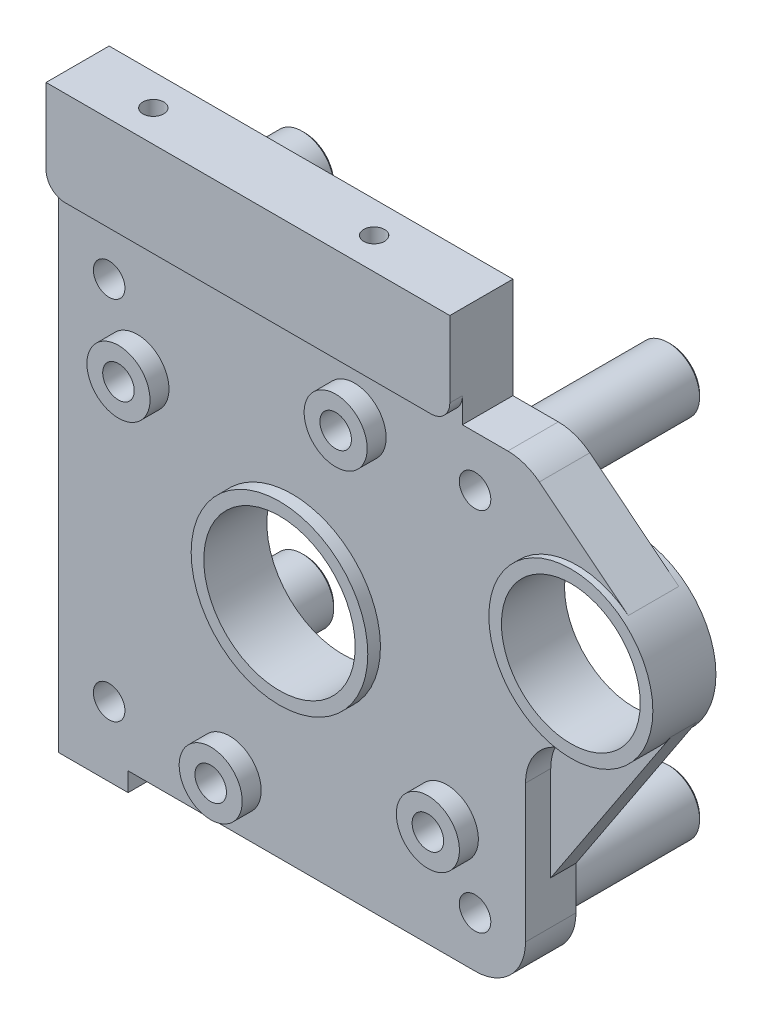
ISO-10303-21;
HEADER;
FILE_DESCRIPTION(('STEP AP214'),'2;1');
FILE_NAME('part.step','',(''),(''),'','','');
FILE_SCHEMA(('AUTOMOTIVE_DESIGN { 1 0 10303 214 1 1 1 1 }'));
ENDSEC;
DATA;
#1=APPLICATION_CONTEXT('core data for automotive mechanical design processes');
#2=APPLICATION_PROTOCOL_DEFINITION('international standard','automotive_design',2000,#1);
#3=PRODUCT_CONTEXT('',#1,'mechanical');
#4=PRODUCT('Part','Part','',(#3));
#5=PRODUCT_RELATED_PRODUCT_CATEGORY('part','',(#4));
#6=PRODUCT_DEFINITION_FORMATION('','',#4);
#7=PRODUCT_DEFINITION_CONTEXT('part definition',#1,'design');
#8=PRODUCT_DEFINITION('design','',#6,#7);
#9=PRODUCT_DEFINITION_SHAPE('','',#8);
#10=(LENGTH_UNIT() NAMED_UNIT(*) SI_UNIT(.MILLI.,.METRE.));
#11=(NAMED_UNIT(*) PLANE_ANGLE_UNIT() SI_UNIT($,.RADIAN.));
#12=(NAMED_UNIT(*) SI_UNIT($,.STERADIAN.) SOLID_ANGLE_UNIT());
#13=UNCERTAINTY_MEASURE_WITH_UNIT(LENGTH_MEASURE(1.E-05),#10,'distance_accuracy_value','');
#14=(GEOMETRIC_REPRESENTATION_CONTEXT(3) GLOBAL_UNCERTAINTY_ASSIGNED_CONTEXT((#13)) GLOBAL_UNIT_ASSIGNED_CONTEXT((#10,
#11,#12)) REPRESENTATION_CONTEXT('',''));
#15=CARTESIAN_POINT('',(0.,0.,0.));
#16=DIRECTION('',(0.,0.,1.));
#17=DIRECTION('',(1.,0.,0.));
#18=AXIS2_PLACEMENT_3D('',#15,#16,#17);
#19=CARTESIAN_POINT('',(45.18539971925,13.81456304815,-6.1));
#20=DIRECTION('',(0.,0.,1.));
#21=DIRECTION('',(1.,0.,0.));
#22=AXIS2_PLACEMENT_3D('',#19,#20,#21);
#23=CYLINDRICAL_SURFACE('',#22,11.);
#24=CARTESIAN_POINT('',(56.18539971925,13.81456304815,5.));
#25=CARTESIAN_POINT('',(56.1853510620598,12.8053456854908,5.));
#26=CARTESIAN_POINT('',(56.0017587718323,11.8129694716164,5.));
#27=CARTESIAN_POINT('',(55.8071622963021,10.7611120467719,5.));
#28=CARTESIAN_POINT('',(55.4130710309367,9.7655212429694,5.));
#29=CARTESIAN_POINT('',(55.0028243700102,8.72911714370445,5.));
#30=CARTESIAN_POINT('',(54.3923503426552,7.79525576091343,5.));
#31=CARTESIAN_POINT('',(53.7693699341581,6.84226297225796,5.));
#32=CARTESIAN_POINT('',(52.963574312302,6.03638845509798,5.));
#33=CARTESIAN_POINT('',(52.1585360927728,5.23127141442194,5.));
#34=CARTESIAN_POINT('',(51.2047070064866,4.60761242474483,5.));
#35=CARTESIAN_POINT('',(50.2717826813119,3.9976219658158,5.));
#36=CARTESIAN_POINT('',(49.2344415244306,3.58689173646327,5.));
#37=CARTESIAN_POINT('',(48.2398596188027,3.19309182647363,5.));
#38=CARTESIAN_POINT('',(47.1869932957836,2.99820399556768,5.));
#39=CARTESIAN_POINT('',(46.1951503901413,2.81461173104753,5.));
#40=CARTESIAN_POINT('',(45.18539971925,2.81456304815,5.));
#41=CARTESIAN_POINT('',(44.1767082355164,2.81451441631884,5.));
#42=CARTESIAN_POINT('',(43.1838061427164,2.99820399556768,5.));
#43=CARTESIAN_POINT('',(42.1319487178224,3.19280047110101,5.));
#44=CARTESIAN_POINT('',(41.1363579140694,3.58689173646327,5.));
#45=CARTESIAN_POINT('',(40.0999538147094,3.9971383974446,5.));
#46=CARTESIAN_POINT('',(39.1660924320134,4.60761242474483,5.));
#47=CARTESIAN_POINT('',(38.2130996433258,5.23059283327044,5.));
#48=CARTESIAN_POINT('',(37.407225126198,6.03638845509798,5.));
#49=CARTESIAN_POINT('',(36.6021080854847,6.8414266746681,5.));
#50=CARTESIAN_POINT('',(35.9784490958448,7.79525576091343,5.));
#51=CARTESIAN_POINT('',(35.3684586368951,8.7281800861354,5.));
#52=CARTESIAN_POINT('',(34.9577284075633,9.7655212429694,5.));
#53=CARTESIAN_POINT('',(34.5639284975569,10.7601031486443,5.));
#54=CARTESIAN_POINT('',(34.3690406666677,11.8129694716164,5.));
#55=CARTESIAN_POINT('',(34.1854484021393,12.8048123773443,5.));
#56=CARTESIAN_POINT('',(34.18539971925,13.81456304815,5.));
#57=B_SPLINE_CURVE_WITH_KNOTS('',2,(#24,#25,#26,#27,#28,#29,#30,#31,#32,#33,#34,#35,#36,#37,#38,
#39,#40,#41,#42,#43,#44,#45,#46,#47,#48,#49,#50,#51,#52,#53,#54,#55,#56),.UNSPECIFIED.,.F.,.F.,
(3,2,2,2,2,2,2,2,2,2,2,2,2,2,2,2,3),(0.,0.0625,0.125,0.1875,0.25,0.3125,0.375,0.4375,0.5,0.5625,
0.625,0.6875,0.75,0.8125,0.875,0.9375,1.),.UNSPECIFIED.);
#58=CARTESIAN_POINT('',(56.18539971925,13.81456304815,5.));
#59=VERTEX_POINT('',#58);
#60=CARTESIAN_POINT('',(34.18539971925,13.81456304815,5.));
#61=VERTEX_POINT('',#60);
#62=EDGE_CURVE('E336',#59,#61,#57,.T.);
#63=ORIENTED_EDGE('',*,*,#62,.F.);
#64=CARTESIAN_POINT('',(34.18539971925,13.81456304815,5.));
#65=CARTESIAN_POINT('',(34.185448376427,14.8237804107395,5.));
#66=CARTESIAN_POINT('',(34.3690406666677,15.8161566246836,5.));
#67=CARTESIAN_POINT('',(34.5636371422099,16.8680140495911,5.));
#68=CARTESIAN_POINT('',(34.9577284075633,17.8636048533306,5.));
#69=CARTESIAN_POINT('',(35.3679750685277,18.9000089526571,5.));
#70=CARTESIAN_POINT('',(35.9784490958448,19.8338703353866,5.));
#71=CARTESIAN_POINT('',(36.6014295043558,20.7868631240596,5.));
#72=CARTESIAN_POINT('',(37.407225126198,21.592737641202,5.));
#73=CARTESIAN_POINT('',(38.2122633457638,22.397854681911,5.));
#74=CARTESIAN_POINT('',(39.1660924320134,23.0215136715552,5.));
#75=CARTESIAN_POINT('',(40.0990167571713,23.6315041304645,5.));
#76=CARTESIAN_POINT('',(41.1363579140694,24.0422343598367,5.));
#77=CARTESIAN_POINT('',(42.1309398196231,24.4360342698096,5.));
#78=CARTESIAN_POINT('',(43.1838061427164,24.6309221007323,5.));
#79=CARTESIAN_POINT('',(44.1756490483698,24.8145143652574,5.));
#80=CARTESIAN_POINT('',(45.18539971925,24.81456304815,5.));
#81=CARTESIAN_POINT('',(46.1940912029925,24.8146116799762,5.));
#82=CARTESIAN_POINT('',(47.1869932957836,24.6309221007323,5.));
#83=CARTESIAN_POINT('',(48.2388507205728,24.4363256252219,5.));
#84=CARTESIAN_POINT('',(49.2344415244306,24.0422343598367,5.));
#85=CARTESIAN_POINT('',(50.2708456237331,23.6319876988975,5.));
#86=CARTESIAN_POINT('',(51.2047070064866,23.0215136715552,5.));
#87=CARTESIAN_POINT('',(52.1576997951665,22.39853326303,5.));
#88=CARTESIAN_POINT('',(52.963574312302,21.592737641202,5.));
#89=CARTESIAN_POINT('',(53.7686913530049,20.7876994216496,5.));
#90=CARTESIAN_POINT('',(54.3923503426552,19.8338703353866,5.));
#91=CARTESIAN_POINT('',(55.0023408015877,18.900946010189,5.));
#92=CARTESIAN_POINT('',(55.4130710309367,17.8636048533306,5.));
#93=CARTESIAN_POINT('',(55.8068709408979,16.8690229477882,5.));
#94=CARTESIAN_POINT('',(56.0017587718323,15.8161566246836,5.));
#95=CARTESIAN_POINT('',(56.1853510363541,14.824313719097,5.));
#96=CARTESIAN_POINT('',(56.18539971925,13.81456304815,5.));
#97=B_SPLINE_CURVE_WITH_KNOTS('',2,(#64,#65,#66,#67,#68,#69,#70,#71,#72,#73,#74,#75,#76,#77,#78,
#79,#80,#81,#82,#83,#84,#85,#86,#87,#88,#89,#90,#91,#92,#93,#94,#95,#96),.UNSPECIFIED.,.F.,.F.,
(3,2,2,2,2,2,2,2,2,2,2,2,2,2,2,2,3),(0.,0.0625,0.125,0.1875,0.25,0.3125,0.375,0.4375,0.5,0.5625,
0.625,0.6875,0.75,0.8125,0.875,0.9375,1.),.UNSPECIFIED.);
#98=EDGE_CURVE('E331',#61,#59,#97,.T.);
#99=ORIENTED_EDGE('',*,*,#98,.F.);
#100=EDGE_LOOP('',(#63,#99));
#101=FACE_BOUND('',#100,.T.);
#102=CARTESIAN_POINT('',(45.18539971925,13.81456304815,-5.));
#103=DIRECTION('',(0.,0.,-1.));
#104=DIRECTION('',(-1.,0.,0.));
#105=AXIS2_PLACEMENT_3D('',#102,#103,#104);
#106=CIRCLE('',#105,11.);
#107=CARTESIAN_POINT('',(34.18539971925,13.81456304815,-5.));
#108=VERTEX_POINT('',#107);
#109=CARTESIAN_POINT('',(56.18539971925,13.81456304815,-5.));
#110=VERTEX_POINT('',#109);
#111=EDGE_CURVE('E340',#108,#110,#106,.T.);
#112=ORIENTED_EDGE('',*,*,#111,.T.);
#113=CARTESIAN_POINT('',(45.18539971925,13.81456304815,-5.));
#114=DIRECTION('',(0.,0.,-1.));
#115=DIRECTION('',(1.,0.,0.));
#116=AXIS2_PLACEMENT_3D('',#113,#114,#115);
#117=CIRCLE('',#116,11.);
#118=EDGE_CURVE('E382',#110,#108,#117,.T.);
#119=ORIENTED_EDGE('',*,*,#118,.T.);
#120=EDGE_LOOP('',(#112,#119));
#121=FACE_BOUND('',#120,.T.);
#122=ADVANCED_FACE('F17',(#101,#121),#23,.F.);
#123=CARTESIAN_POINT('',(0.,38.,0.));
#124=DIRECTION('',(0.,1.,0.));
#125=DIRECTION('',(0.,0.,1.));
#126=AXIS2_PLACEMENT_3D('',#123,#124,#125);
#127=PLANE('',#126);
#128=CARTESIAN_POINT('',(-23.35,38.,1.));
#129=CARTESIAN_POINT('',(-23.3501011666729,38.,0.685285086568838));
#130=CARTESIAN_POINT('',(-23.465849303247,38.,0.39264372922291));
#131=CARTESIAN_POINT('',(-23.5913433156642,38.,0.0753622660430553));
#132=CARTESIAN_POINT('',(-23.8332738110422,38.,-0.166726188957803));
#133=CARTESIAN_POINT('',(-24.0744593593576,38.,-0.408069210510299));
#134=CARTESIAN_POINT('',(-24.3926437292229,38.,-0.53415069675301));
#135=CARTESIAN_POINT('',(-24.6847500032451,38.,-0.649898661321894));
#136=CARTESIAN_POINT('',(-25.,38.,-0.65));
#137=CARTESIAN_POINT('',(-25.3142037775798,38.,-0.650101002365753));
#138=CARTESIAN_POINT('',(-25.6073562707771,38.,-0.53415069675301));
#139=CARTESIAN_POINT('',(-25.9246377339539,38.,-0.408656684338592));
#140=CARTESIAN_POINT('',(-26.1667261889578,38.,-0.166726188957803));
#141=CARTESIAN_POINT('',(-26.4080692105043,38.,0.0744593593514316));
#142=CARTESIAN_POINT('',(-26.534150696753,38.,0.39264372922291));
#143=CARTESIAN_POINT('',(-26.6498986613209,38.,0.684750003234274));
#144=CARTESIAN_POINT('',(-26.65,38.,1.));
#145=B_SPLINE_CURVE_WITH_KNOTS('',2,(#128,#129,#130,#131,#132,#133,#134,#135,#136,#137,#138,
#139,#140,#141,#142,#143,#144),.UNSPECIFIED.,.F.,.F.,(3,2,2,2,2,2,2,2,3),(0.,0.125,0.25,0.375,
0.5,0.625,0.75,0.875,1.),.UNSPECIFIED.);
#146=CARTESIAN_POINT('',(-23.35,38.,1.));
#147=VERTEX_POINT('',#146);
#148=CARTESIAN_POINT('',(-26.65,38.,1.));
#149=VERTEX_POINT('',#148);
#150=EDGE_CURVE('E386',#147,#149,#145,.T.);
#151=ORIENTED_EDGE('',*,*,#150,.T.);
#152=CARTESIAN_POINT('',(-26.65,38.,1.));
#153=CARTESIAN_POINT('',(-26.6498988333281,38.,1.31471491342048));
#154=CARTESIAN_POINT('',(-26.534150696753,38.,1.60735627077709));
#155=CARTESIAN_POINT('',(-26.40865668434,38.,1.92463773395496));
#156=CARTESIAN_POINT('',(-26.1667261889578,38.,2.1667261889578));
#157=CARTESIAN_POINT('',(-25.9255406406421,38.,2.4080692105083));
#158=CARTESIAN_POINT('',(-25.6073562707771,38.,2.53415069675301));
#159=CARTESIAN_POINT('',(-25.3152499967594,38.,2.64989866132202));
#160=CARTESIAN_POINT('',(-25.,38.,2.65));
#161=CARTESIAN_POINT('',(-24.6857962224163,38.,2.65010100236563));
#162=CARTESIAN_POINT('',(-24.3926437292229,38.,2.53415069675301));
#163=CARTESIAN_POINT('',(-24.075362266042,38.,2.40865668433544));
#164=CARTESIAN_POINT('',(-23.8332738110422,38.,2.1667261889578));
#165=CARTESIAN_POINT('',(-23.5919307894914,38.,1.92554064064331));
#166=CARTESIAN_POINT('',(-23.465849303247,38.,1.60735627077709));
#167=CARTESIAN_POINT('',(-23.3501013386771,38.,1.3152499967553));
#168=CARTESIAN_POINT('',(-23.35,38.,1.));
#169=B_SPLINE_CURVE_WITH_KNOTS('',2,(#152,#153,#154,#155,#156,#157,#158,#159,#160,#161,#162,
#163,#164,#165,#166,#167,#168),.UNSPECIFIED.,.F.,.F.,(3,2,2,2,2,2,2,2,3),(0.,0.125,0.25,0.375,
0.5,0.625,0.75,0.875,1.),.UNSPECIFIED.);
#170=EDGE_CURVE('E392',#149,#147,#169,.T.);
#171=ORIENTED_EDGE('',*,*,#170,.T.);
#172=EDGE_LOOP('',(#151,#171));
#173=FACE_BOUND('',#172,.T.);
#174=ADVANCED_FACE('F364',(#173),#127,.T.);
#175=CARTESIAN_POINT('',(0.,38.,0.));
#176=DIRECTION('',(0.,1.,0.));
#177=DIRECTION('',(0.,0.,1.));
#178=AXIS2_PLACEMENT_3D('',#175,#176,#177);
#179=PLANE('',#178);
#180=CARTESIAN_POINT('',(11.65,38.,1.));
#181=CARTESIAN_POINT('',(11.6498988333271,38.,0.68528508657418));
#182=CARTESIAN_POINT('',(11.534150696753,38.,0.39264372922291));
#183=CARTESIAN_POINT('',(11.4086566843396,38.,0.0753622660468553));
#184=CARTESIAN_POINT('',(11.1667261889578,38.,-0.166726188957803));
#185=CARTESIAN_POINT('',(10.9255406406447,38.,-0.408069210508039));
#186=CARTESIAN_POINT('',(10.6073562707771,38.,-0.53415069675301));
#187=CARTESIAN_POINT('',(10.315249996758,38.,-0.649898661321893));
#188=CARTESIAN_POINT('',(10.,38.,-0.65));
#189=CARTESIAN_POINT('',(9.68579622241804,38.,-0.650101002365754));
#190=CARTESIAN_POINT('',(9.39264372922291,38.,-0.53415069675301));
#191=CARTESIAN_POINT('',(9.07536226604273,38.,-0.408656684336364));
#192=CARTESIAN_POINT('',(8.8332738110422,38.,-0.166726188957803));
#193=CARTESIAN_POINT('',(8.59193078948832,38.,0.0744593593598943));
#194=CARTESIAN_POINT('',(8.46584930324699,38.,0.39264372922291));
#195=CARTESIAN_POINT('',(8.35010133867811,38.,0.684750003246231));
#196=CARTESIAN_POINT('',(8.35,38.,1.));
#197=B_SPLINE_CURVE_WITH_KNOTS('',2,(#180,#181,#182,#183,#184,#185,#186,#187,#188,#189,#190,
#191,#192,#193,#194,#195,#196),.UNSPECIFIED.,.F.,.F.,(3,2,2,2,2,2,2,2,3),(0.,0.125,0.25,0.375,
0.5,0.625,0.75,0.875,1.),.UNSPECIFIED.);
#198=CARTESIAN_POINT('',(11.65,38.,1.));
#199=VERTEX_POINT('',#198);
#200=CARTESIAN_POINT('',(8.35,38.,1.));
#201=VERTEX_POINT('',#200);
#202=EDGE_CURVE('E2176',#199,#201,#197,.T.);
#203=ORIENTED_EDGE('',*,*,#202,.T.);
#204=CARTESIAN_POINT('',(8.35,38.,1.));
#205=CARTESIAN_POINT('',(8.35010116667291,38.,1.31471491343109));
#206=CARTESIAN_POINT('',(8.46584930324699,38.,1.60735627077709));
#207=CARTESIAN_POINT('',(8.59134331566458,38.,1.92463773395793));
#208=CARTESIAN_POINT('',(8.8332738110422,38.,2.1667261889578));
#209=CARTESIAN_POINT('',(9.07445935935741,38.,2.40806921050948));
#210=CARTESIAN_POINT('',(9.39264372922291,38.,2.53415069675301));
#211=CARTESIAN_POINT('',(9.68475000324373,38.,2.64989866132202));
#212=CARTESIAN_POINT('',(10.,38.,2.65));
#213=CARTESIAN_POINT('',(10.31420377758,38.,2.65010100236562));
#214=CARTESIAN_POINT('',(10.6073562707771,38.,2.53415069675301));
#215=CARTESIAN_POINT('',(10.9246377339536,38.,2.40865668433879));
#216=CARTESIAN_POINT('',(11.1667261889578,38.,2.1667261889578));
#217=CARTESIAN_POINT('',(11.408069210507,38.,1.92554064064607));
#218=CARTESIAN_POINT('',(11.534150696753,38.,1.60735627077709));
#219=CARTESIAN_POINT('',(11.6498986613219,38.,1.31524999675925));
#220=CARTESIAN_POINT('',(11.65,38.,1.));
#221=B_SPLINE_CURVE_WITH_KNOTS('',2,(#204,#205,#206,#207,#208,#209,#210,#211,#212,#213,#214,
#215,#216,#217,#218,#219,#220),.UNSPECIFIED.,.F.,.F.,(3,2,2,2,2,2,2,2,3),(0.,0.125,0.25,0.375,
0.5,0.625,0.75,0.875,1.),.UNSPECIFIED.);
#222=EDGE_CURVE('E2428',#201,#199,#221,.T.);
#223=ORIENTED_EDGE('',*,*,#222,.T.);
#224=EDGE_LOOP('',(#203,#223));
#225=FACE_BOUND('',#224,.T.);
#226=ADVANCED_FACE('F2455',(#225),#179,.T.);
#227=CARTESIAN_POINT('',(24.,38.,-4.));
#228=DIRECTION('',(0.,-1.,0.));
#229=DIRECTION('',(0.,0.,-1.));
#230=AXIS2_PLACEMENT_3D('',#227,#228,#229);
#231=PLANE('',#230);
#232=DIRECTION('',(0.,0.,-1.));
#233=VECTOR('',#232,1.);
#234=CARTESIAN_POINT('',(-34.,38.,-4.));
#235=LINE('',#234,#233);
#236=CARTESIAN_POINT('',(-34.,38.,4.));
#237=VERTEX_POINT('',#236);
#238=CARTESIAN_POINT('',(-34.,38.,6.));
#239=VERTEX_POINT('',#238);
#240=EDGE_CURVE('E2124',#237,#239,#235,.F.);
#241=ORIENTED_EDGE('',*,*,#240,.F.);
#242=DIRECTION('',(1.,0.,0.));
#243=VECTOR('',#242,1.);
#244=CARTESIAN_POINT('',(0.,38.,4.));
#245=LINE('',#244,#243);
#246=CARTESIAN_POINT('',(24.,38.,4.));
#247=VERTEX_POINT('',#246);
#248=EDGE_CURVE('E505',#247,#237,#245,.F.);
#249=ORIENTED_EDGE('',*,*,#248,.F.);
#250=DIRECTION('',(0.,0.,-1.));
#251=VECTOR('',#250,1.);
#252=CARTESIAN_POINT('',(24.,38.,-4.));
#253=LINE('',#252,#251);
#254=CARTESIAN_POINT('',(24.,38.,6.));
#255=VERTEX_POINT('',#254);
#256=EDGE_CURVE('E385',#255,#247,#253,.T.);
#257=ORIENTED_EDGE('',*,*,#256,.F.);
#258=DIRECTION('',(-1.,0.,0.));
#259=VECTOR('',#258,1.);
#260=CARTESIAN_POINT('',(0.,38.,6.));
#261=LINE('',#260,#259);
#262=EDGE_CURVE('E514',#255,#239,#261,.T.);
#263=ORIENTED_EDGE('',*,*,#262,.T.);
#264=EDGE_LOOP('',(#241,#249,#257,#263));
#265=FACE_BOUND('',#264,.T.);
#266=ADVANCED_FACE('F460',(#265),#231,.T.);
#267=CARTESIAN_POINT('',(-29.,-29.,4.));
#268=DIRECTION('',(0.,0.,-1.));
#269=DIRECTION('',(-1.,0.,0.));
#270=AXIS2_PLACEMENT_3D('',#267,#268,#269);
#271=CYLINDRICAL_SURFACE('',#270,2.5);
#272=CARTESIAN_POINT('',(-31.5,-29.,-27.));
#273=CARTESIAN_POINT('',(-31.4998988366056,-29.4768469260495,-27.));
#274=CARTESIAN_POINT('',(-31.3244707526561,-29.9202367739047,-27.));
#275=CARTESIAN_POINT('',(-31.134177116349,-30.4011989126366,-27.));
#276=CARTESIAN_POINT('',(-30.7677669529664,-30.7677669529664,-27.));
#277=CARTESIAN_POINT('',(-30.4021018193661,-31.1335896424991,-27.));
#278=CARTESIAN_POINT('',(-29.9202367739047,-31.3244707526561,-27.));
#279=CARTESIAN_POINT('',(-29.4773820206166,-31.499898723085,-27.));
#280=CARTESIAN_POINT('',(-29.,-31.5,-27.));
#281=CARTESIAN_POINT('',(-28.5236641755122,-31.5001010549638,-27.));
#282=CARTESIAN_POINT('',(-28.0797632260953,-31.3244707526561,-27.));
#283=CARTESIAN_POINT('',(-27.5988010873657,-31.1341771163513,-27.));
#284=CARTESIAN_POINT('',(-27.2322330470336,-30.7677669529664,-27.));
#285=CARTESIAN_POINT('',(-26.8664103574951,-30.4021018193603,-27.));
#286=CARTESIAN_POINT('',(-26.6755292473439,-29.9202367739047,-27.));
#287=CARTESIAN_POINT('',(-26.5001012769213,-29.4773820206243,-27.));
#288=CARTESIAN_POINT('',(-26.5,-29.,-27.));
#289=B_SPLINE_CURVE_WITH_KNOTS('',2,(#272,#273,#274,#275,#276,#277,#278,#279,#280,#281,#282,
#283,#284,#285,#286,#287,#288),.UNSPECIFIED.,.F.,.F.,(3,2,2,2,2,2,2,2,3),(0.,0.125,0.25,0.375,
0.5,0.625,0.75,0.875,1.),.UNSPECIFIED.);
#290=CARTESIAN_POINT('',(-31.5,-29.,-27.));
#291=VERTEX_POINT('',#290);
#292=CARTESIAN_POINT('',(-26.5,-29.,-27.));
#293=VERTEX_POINT('',#292);
#294=EDGE_CURVE('E442',#291,#293,#289,.T.);
#295=ORIENTED_EDGE('',*,*,#294,.F.);
#296=CARTESIAN_POINT('',(-26.5,-29.,-27.));
#297=CARTESIAN_POINT('',(-26.5001011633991,-28.5231530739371,-27.));
#298=CARTESIAN_POINT('',(-26.6755292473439,-28.0797632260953,-27.));
#299=CARTESIAN_POINT('',(-26.8658228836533,-27.5988010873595,-27.));
#300=CARTESIAN_POINT('',(-27.2322330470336,-27.2322330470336,-27.));
#301=CARTESIAN_POINT('',(-27.5978981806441,-26.8664103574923,-27.));
#302=CARTESIAN_POINT('',(-28.0797632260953,-26.6755292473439,-27.));
#303=CARTESIAN_POINT('',(-28.522617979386,-26.5001012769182,-27.));
#304=CARTESIAN_POINT('',(-29.,-26.5,-27.));
#305=CARTESIAN_POINT('',(-29.476335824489,-26.499898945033,-27.));
#306=CARTESIAN_POINT('',(-29.9202367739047,-26.6755292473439,-27.));
#307=CARTESIAN_POINT('',(-30.4011989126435,-26.8658228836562,-27.));
#308=CARTESIAN_POINT('',(-30.7677669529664,-27.2322330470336,-27.));
#309=CARTESIAN_POINT('',(-31.1335896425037,-27.5978981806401,-27.));
#310=CARTESIAN_POINT('',(-31.3244707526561,-28.0797632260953,-27.));
#311=CARTESIAN_POINT('',(-31.499898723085,-28.5226179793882,-27.));
#312=CARTESIAN_POINT('',(-31.5,-29.,-27.));
#313=B_SPLINE_CURVE_WITH_KNOTS('',2,(#296,#297,#298,#299,#300,#301,#302,#303,#304,#305,#306,
#307,#308,#309,#310,#311,#312),.UNSPECIFIED.,.F.,.F.,(3,2,2,2,2,2,2,2,3),(0.,0.125,0.25,0.375,
0.5,0.625,0.75,0.875,1.),.UNSPECIFIED.);
#314=EDGE_CURVE('E1147',#293,#291,#313,.T.);
#315=ORIENTED_EDGE('',*,*,#314,.F.);
#316=EDGE_LOOP('',(#295,#315));
#317=FACE_BOUND('',#316,.T.);
#318=CARTESIAN_POINT('',(-31.5,-29.,4.));
#319=CARTESIAN_POINT('',(-31.4998988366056,-28.5231530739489,4.));
#320=CARTESIAN_POINT('',(-31.3244707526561,-28.0797632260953,4.));
#321=CARTESIAN_POINT('',(-31.1341771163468,-27.5988010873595,4.));
#322=CARTESIAN_POINT('',(-30.7677669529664,-27.2322330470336,4.));
#323=CARTESIAN_POINT('',(-30.4021018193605,-26.8664103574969,4.));
#324=CARTESIAN_POINT('',(-29.9202367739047,-26.6755292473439,4.));
#325=CARTESIAN_POINT('',(-29.4773820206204,-26.5001012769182,4.));
#326=CARTESIAN_POINT('',(-29.,-26.5,4.));
#327=CARTESIAN_POINT('',(-28.5236641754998,-26.499898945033,4.));
#328=CARTESIAN_POINT('',(-28.0797632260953,-26.6755292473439,4.));
#329=CARTESIAN_POINT('',(-27.5988010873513,-26.8658228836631,4.));
#330=CARTESIAN_POINT('',(-27.2322330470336,-27.2322330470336,4.));
#331=CARTESIAN_POINT('',(-26.8664103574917,-27.5978981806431,4.));
#332=CARTESIAN_POINT('',(-26.6755292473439,-28.0797632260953,4.));
#333=CARTESIAN_POINT('',(-26.5001012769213,-28.5226179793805,4.));
#334=CARTESIAN_POINT('',(-26.5,-29.,4.));
#335=B_SPLINE_CURVE_WITH_KNOTS('',2,(#318,#319,#320,#321,#322,#323,#324,#325,#326,#327,#328,
#329,#330,#331,#332,#333,#334),.UNSPECIFIED.,.F.,.F.,(3,2,2,2,2,2,2,2,3),(0.,0.125,0.25,0.375,
0.5,0.625,0.75,0.875,1.),.UNSPECIFIED.);
#336=CARTESIAN_POINT('',(-31.5,-29.,4.));
#337=VERTEX_POINT('',#336);
#338=CARTESIAN_POINT('',(-26.5,-29.,4.));
#339=VERTEX_POINT('',#338);
#340=EDGE_CURVE('E484',#337,#339,#335,.T.);
#341=ORIENTED_EDGE('',*,*,#340,.F.);
#342=CARTESIAN_POINT('',(-26.5,-29.,4.));
#343=CARTESIAN_POINT('',(-26.5001011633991,-29.4768469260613,4.));
#344=CARTESIAN_POINT('',(-26.6755292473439,-29.9202367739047,4.));
#345=CARTESIAN_POINT('',(-26.865822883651,-30.4011989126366,4.));
#346=CARTESIAN_POINT('',(-27.2322330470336,-30.7677669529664,4.));
#347=CARTESIAN_POINT('',(-27.5978981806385,-31.1335896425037,4.));
#348=CARTESIAN_POINT('',(-28.0797632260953,-31.3244707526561,4.));
#349=CARTESIAN_POINT('',(-28.5226179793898,-31.499898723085,4.));
#350=CARTESIAN_POINT('',(-29.,-31.5,4.));
#351=CARTESIAN_POINT('',(-29.4763358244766,-31.5001010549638,4.));
#352=CARTESIAN_POINT('',(-29.9202367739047,-31.3244707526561,4.));
#353=CARTESIAN_POINT('',(-30.4011989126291,-31.1341771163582,4.));
#354=CARTESIAN_POINT('',(-30.7677669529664,-30.7677669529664,4.));
#355=CARTESIAN_POINT('',(-31.1335896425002,-30.4021018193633,4.));
#356=CARTESIAN_POINT('',(-31.3244707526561,-29.9202367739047,4.));
#357=CARTESIAN_POINT('',(-31.499898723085,-29.4773820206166,4.));
#358=CARTESIAN_POINT('',(-31.5,-29.,4.));
#359=B_SPLINE_CURVE_WITH_KNOTS('',2,(#342,#343,#344,#345,#346,#347,#348,#349,#350,#351,#352,
#353,#354,#355,#356,#357,#358),.UNSPECIFIED.,.F.,.F.,(3,2,2,2,2,2,2,2,3),(0.,0.125,0.25,0.375,
0.5,0.625,0.75,0.875,1.),.UNSPECIFIED.);
#360=EDGE_CURVE('E492',#339,#337,#359,.T.);
#361=ORIENTED_EDGE('',*,*,#360,.F.);
#362=EDGE_LOOP('',(#341,#361));
#363=FACE_BOUND('',#362,.T.);
#364=ADVANCED_FACE('F449',(#317,#363),#271,.F.);
#365=CARTESIAN_POINT('',(29.,-29.,4.));
#366=DIRECTION('',(0.,0.,-1.));
#367=DIRECTION('',(-1.,0.,0.));
#368=AXIS2_PLACEMENT_3D('',#365,#366,#367);
#369=CYLINDRICAL_SURFACE('',#368,2.5);
#370=CARTESIAN_POINT('',(26.5,-29.,-27.));
#371=CARTESIAN_POINT('',(26.5001011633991,-29.4768469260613,-27.));
#372=CARTESIAN_POINT('',(26.6755292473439,-29.9202367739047,-27.));
#373=CARTESIAN_POINT('',(26.865822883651,-30.4011989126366,-27.));
#374=CARTESIAN_POINT('',(27.2322330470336,-30.7677669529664,-27.));
#375=CARTESIAN_POINT('',(27.5978981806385,-31.1335896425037,-27.));
#376=CARTESIAN_POINT('',(28.0797632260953,-31.3244707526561,-27.));
#377=CARTESIAN_POINT('',(28.5226179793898,-31.499898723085,-27.));
#378=CARTESIAN_POINT('',(29.,-31.5,-27.));
#379=CARTESIAN_POINT('',(29.4763358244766,-31.5001010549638,-27.));
#380=CARTESIAN_POINT('',(29.9202367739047,-31.3244707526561,-27.));
#381=CARTESIAN_POINT('',(30.4011989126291,-31.1341771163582,-27.));
#382=CARTESIAN_POINT('',(30.7677669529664,-30.7677669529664,-27.));
#383=CARTESIAN_POINT('',(31.1335896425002,-30.4021018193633,-27.));
#384=CARTESIAN_POINT('',(31.3244707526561,-29.9202367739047,-27.));
#385=CARTESIAN_POINT('',(31.499898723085,-29.4773820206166,-27.));
#386=CARTESIAN_POINT('',(31.5,-29.,-27.));
#387=B_SPLINE_CURVE_WITH_KNOTS('',2,(#370,#371,#372,#373,#374,#375,#376,#377,#378,#379,#380,
#381,#382,#383,#384,#385,#386),.UNSPECIFIED.,.F.,.F.,(3,2,2,2,2,2,2,2,3),(0.,0.125,0.25,0.375,
0.5,0.625,0.75,0.875,1.),.UNSPECIFIED.);
#388=CARTESIAN_POINT('',(26.5,-29.,-27.));
#389=VERTEX_POINT('',#388);
#390=CARTESIAN_POINT('',(31.5,-29.,-27.));
#391=VERTEX_POINT('',#390);
#392=EDGE_CURVE('E1097',#389,#391,#387,.T.);
#393=ORIENTED_EDGE('',*,*,#392,.F.);
#394=CARTESIAN_POINT('',(31.5,-29.,-27.));
#395=CARTESIAN_POINT('',(31.4998988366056,-28.5231530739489,-27.));
#396=CARTESIAN_POINT('',(31.3244707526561,-28.0797632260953,-27.));
#397=CARTESIAN_POINT('',(31.1341771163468,-27.5988010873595,-27.));
#398=CARTESIAN_POINT('',(30.7677669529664,-27.2322330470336,-27.));
#399=CARTESIAN_POINT('',(30.4021018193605,-26.8664103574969,-27.));
#400=CARTESIAN_POINT('',(29.9202367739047,-26.6755292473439,-27.));
#401=CARTESIAN_POINT('',(29.4773820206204,-26.5001012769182,-27.));
#402=CARTESIAN_POINT('',(29.,-26.5,-27.));
#403=CARTESIAN_POINT('',(28.5236641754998,-26.499898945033,-27.));
#404=CARTESIAN_POINT('',(28.0797632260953,-26.6755292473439,-27.));
#405=CARTESIAN_POINT('',(27.5988010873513,-26.8658228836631,-27.));
#406=CARTESIAN_POINT('',(27.2322330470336,-27.2322330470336,-27.));
#407=CARTESIAN_POINT('',(26.8664103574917,-27.5978981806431,-27.));
#408=CARTESIAN_POINT('',(26.6755292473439,-28.0797632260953,-27.));
#409=CARTESIAN_POINT('',(26.5001012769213,-28.5226179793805,-27.));
#410=CARTESIAN_POINT('',(26.5,-29.,-27.));
#411=B_SPLINE_CURVE_WITH_KNOTS('',2,(#394,#395,#396,#397,#398,#399,#400,#401,#402,#403,#404,
#405,#406,#407,#408,#409,#410),.UNSPECIFIED.,.F.,.F.,(3,2,2,2,2,2,2,2,3),(0.,0.125,0.25,0.375,
0.5,0.625,0.75,0.875,1.),.UNSPECIFIED.);
#412=EDGE_CURVE('E1087',#391,#389,#411,.T.);
#413=ORIENTED_EDGE('',*,*,#412,.F.);
#414=EDGE_LOOP('',(#393,#413));
#415=FACE_BOUND('',#414,.T.);
#416=CARTESIAN_POINT('',(26.5,-29.,4.));
#417=CARTESIAN_POINT('',(26.5001011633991,-28.5231530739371,4.));
#418=CARTESIAN_POINT('',(26.6755292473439,-28.0797632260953,4.));
#419=CARTESIAN_POINT('',(26.8658228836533,-27.5988010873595,4.));
#420=CARTESIAN_POINT('',(27.2322330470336,-27.2322330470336,4.));
#421=CARTESIAN_POINT('',(27.5978981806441,-26.8664103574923,4.));
#422=CARTESIAN_POINT('',(28.0797632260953,-26.6755292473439,4.));
#423=CARTESIAN_POINT('',(28.522617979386,-26.5001012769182,4.));
#424=CARTESIAN_POINT('',(29.,-26.5,4.));
#425=CARTESIAN_POINT('',(29.476335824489,-26.499898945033,4.));
#426=CARTESIAN_POINT('',(29.9202367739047,-26.6755292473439,4.));
#427=CARTESIAN_POINT('',(30.4011989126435,-26.8658228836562,4.));
#428=CARTESIAN_POINT('',(30.7677669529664,-27.2322330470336,4.));
#429=CARTESIAN_POINT('',(31.1335896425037,-27.5978981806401,4.));
#430=CARTESIAN_POINT('',(31.3244707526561,-28.0797632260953,4.));
#431=CARTESIAN_POINT('',(31.499898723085,-28.5226179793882,4.));
#432=CARTESIAN_POINT('',(31.5,-29.,4.));
#433=B_SPLINE_CURVE_WITH_KNOTS('',2,(#416,#417,#418,#419,#420,#421,#422,#423,#424,#425,#426,
#427,#428,#429,#430,#431,#432),.UNSPECIFIED.,.F.,.F.,(3,2,2,2,2,2,2,2,3),(0.,0.125,0.25,0.375,
0.5,0.625,0.75,0.875,1.),.UNSPECIFIED.);
#434=CARTESIAN_POINT('',(26.5,-29.,4.));
#435=VERTEX_POINT('',#434);
#436=CARTESIAN_POINT('',(31.5,-29.,4.));
#437=VERTEX_POINT('',#436);
#438=EDGE_CURVE('E496',#435,#437,#433,.T.);
#439=ORIENTED_EDGE('',*,*,#438,.F.);
#440=CARTESIAN_POINT('',(31.5,-29.,4.));
#441=CARTESIAN_POINT('',(31.4998988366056,-29.4768469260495,4.));
#442=CARTESIAN_POINT('',(31.3244707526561,-29.9202367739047,4.));
#443=CARTESIAN_POINT('',(31.134177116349,-30.4011989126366,4.));
#444=CARTESIAN_POINT('',(30.7677669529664,-30.7677669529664,4.));
#445=CARTESIAN_POINT('',(30.4021018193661,-31.1335896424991,4.));
#446=CARTESIAN_POINT('',(29.9202367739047,-31.3244707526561,4.));
#447=CARTESIAN_POINT('',(29.4773820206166,-31.499898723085,4.));
#448=CARTESIAN_POINT('',(29.,-31.5,4.));
#449=CARTESIAN_POINT('',(28.5236641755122,-31.5001010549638,4.));
#450=CARTESIAN_POINT('',(28.0797632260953,-31.3244707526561,4.));
#451=CARTESIAN_POINT('',(27.5988010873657,-31.1341771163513,4.));
#452=CARTESIAN_POINT('',(27.2322330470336,-30.7677669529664,4.));
#453=CARTESIAN_POINT('',(26.8664103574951,-30.4021018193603,4.));
#454=CARTESIAN_POINT('',(26.6755292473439,-29.9202367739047,4.));
#455=CARTESIAN_POINT('',(26.5001012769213,-29.4773820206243,4.));
#456=CARTESIAN_POINT('',(26.5,-29.,4.));
#457=B_SPLINE_CURVE_WITH_KNOTS('',2,(#440,#441,#442,#443,#444,#445,#446,#447,#448,#449,#450,
#451,#452,#453,#454,#455,#456),.UNSPECIFIED.,.F.,.F.,(3,2,2,2,2,2,2,2,3),(0.,0.125,0.25,0.375,
0.5,0.625,0.75,0.875,1.),.UNSPECIFIED.);
#458=EDGE_CURVE('E1337',#437,#435,#457,.T.);
#459=ORIENTED_EDGE('',*,*,#458,.F.);
#460=EDGE_LOOP('',(#439,#459));
#461=FACE_BOUND('',#460,.T.);
#462=ADVANCED_FACE('F459',(#415,#461),#369,.F.);
#463=CARTESIAN_POINT('',(29.,29.,4.));
#464=DIRECTION('',(0.,0.,-1.));
#465=DIRECTION('',(-1.,0.,0.));
#466=AXIS2_PLACEMENT_3D('',#463,#464,#465);
#467=CYLINDRICAL_SURFACE('',#466,2.5);
#468=CARTESIAN_POINT('',(26.5,29.,-27.));
#469=CARTESIAN_POINT('',(26.5001011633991,28.5231530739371,-27.));
#470=CARTESIAN_POINT('',(26.6755292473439,28.0797632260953,-27.));
#471=CARTESIAN_POINT('',(26.8658228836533,27.5988010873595,-27.));
#472=CARTESIAN_POINT('',(27.2322330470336,27.2322330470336,-27.));
#473=CARTESIAN_POINT('',(27.5978981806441,26.8664103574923,-27.));
#474=CARTESIAN_POINT('',(28.0797632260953,26.6755292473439,-27.));
#475=CARTESIAN_POINT('',(28.522617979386,26.5001012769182,-27.));
#476=CARTESIAN_POINT('',(29.,26.5,-27.));
#477=CARTESIAN_POINT('',(29.476335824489,26.499898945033,-27.));
#478=CARTESIAN_POINT('',(29.9202367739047,26.6755292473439,-27.));
#479=CARTESIAN_POINT('',(30.4011989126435,26.8658228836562,-27.));
#480=CARTESIAN_POINT('',(30.7677669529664,27.2322330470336,-27.));
#481=CARTESIAN_POINT('',(31.1335896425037,27.5978981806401,-27.));
#482=CARTESIAN_POINT('',(31.3244707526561,28.0797632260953,-27.));
#483=CARTESIAN_POINT('',(31.499898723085,28.5226179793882,-27.));
#484=CARTESIAN_POINT('',(31.5,29.,-27.));
#485=B_SPLINE_CURVE_WITH_KNOTS('',2,(#468,#469,#470,#471,#472,#473,#474,#475,#476,#477,#478,
#479,#480,#481,#482,#483,#484),.UNSPECIFIED.,.F.,.F.,(3,2,2,2,2,2,2,2,3),(0.,0.125,0.25,0.375,
0.5,0.625,0.75,0.875,1.),.UNSPECIFIED.);
#486=CARTESIAN_POINT('',(26.5,29.,-27.));
#487=VERTEX_POINT('',#486);
#488=CARTESIAN_POINT('',(31.5,29.,-27.));
#489=VERTEX_POINT('',#488);
#490=EDGE_CURVE('E1034',#487,#489,#485,.T.);
#491=ORIENTED_EDGE('',*,*,#490,.F.);
#492=CARTESIAN_POINT('',(31.5,29.,-27.));
#493=CARTESIAN_POINT('',(31.4998988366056,29.4768469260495,-27.));
#494=CARTESIAN_POINT('',(31.3244707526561,29.9202367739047,-27.));
#495=CARTESIAN_POINT('',(31.134177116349,30.4011989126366,-27.));
#496=CARTESIAN_POINT('',(30.7677669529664,30.7677669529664,-27.));
#497=CARTESIAN_POINT('',(30.4021018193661,31.1335896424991,-27.));
#498=CARTESIAN_POINT('',(29.9202367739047,31.3244707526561,-27.));
#499=CARTESIAN_POINT('',(29.4773820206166,31.499898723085,-27.));
#500=CARTESIAN_POINT('',(29.,31.5,-27.));
#501=CARTESIAN_POINT('',(28.5236641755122,31.5001010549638,-27.));
#502=CARTESIAN_POINT('',(28.0797632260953,31.3244707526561,-27.));
#503=CARTESIAN_POINT('',(27.5988010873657,31.1341771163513,-27.));
#504=CARTESIAN_POINT('',(27.2322330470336,30.7677669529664,-27.));
#505=CARTESIAN_POINT('',(26.8664103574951,30.4021018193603,-27.));
#506=CARTESIAN_POINT('',(26.6755292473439,29.9202367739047,-27.));
#507=CARTESIAN_POINT('',(26.5001012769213,29.4773820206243,-27.));
#508=CARTESIAN_POINT('',(26.5,29.,-27.));
#509=B_SPLINE_CURVE_WITH_KNOTS('',2,(#492,#493,#494,#495,#496,#497,#498,#499,#500,#501,#502,
#503,#504,#505,#506,#507,#508),.UNSPECIFIED.,.F.,.F.,(3,2,2,2,2,2,2,2,3),(0.,0.125,0.25,0.375,
0.5,0.625,0.75,0.875,1.),.UNSPECIFIED.);
#510=EDGE_CURVE('E1683',#489,#487,#509,.T.);
#511=ORIENTED_EDGE('',*,*,#510,.F.);
#512=EDGE_LOOP('',(#491,#511));
#513=FACE_BOUND('',#512,.T.);
#514=CARTESIAN_POINT('',(26.5,29.,4.));
#515=CARTESIAN_POINT('',(26.5001011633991,29.4768469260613,4.));
#516=CARTESIAN_POINT('',(26.6755292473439,29.9202367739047,4.));
#517=CARTESIAN_POINT('',(26.865822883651,30.4011989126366,4.));
#518=CARTESIAN_POINT('',(27.2322330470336,30.7677669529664,4.));
#519=CARTESIAN_POINT('',(27.5978981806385,31.1335896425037,4.));
#520=CARTESIAN_POINT('',(28.0797632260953,31.3244707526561,4.));
#521=CARTESIAN_POINT('',(28.5226179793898,31.499898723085,4.));
#522=CARTESIAN_POINT('',(29.,31.5,4.));
#523=CARTESIAN_POINT('',(29.4763358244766,31.5001010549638,4.));
#524=CARTESIAN_POINT('',(29.9202367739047,31.3244707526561,4.));
#525=CARTESIAN_POINT('',(30.4011989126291,31.1341771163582,4.));
#526=CARTESIAN_POINT('',(30.7677669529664,30.7677669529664,4.));
#527=CARTESIAN_POINT('',(31.1335896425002,30.4021018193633,4.));
#528=CARTESIAN_POINT('',(31.3244707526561,29.9202367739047,4.));
#529=CARTESIAN_POINT('',(31.499898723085,29.4773820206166,4.));
#530=CARTESIAN_POINT('',(31.5,29.,4.));
#531=B_SPLINE_CURVE_WITH_KNOTS('',2,(#514,#515,#516,#517,#518,#519,#520,#521,#522,#523,#524,
#525,#526,#527,#528,#529,#530),.UNSPECIFIED.,.F.,.F.,(3,2,2,2,2,2,2,2,3),(0.,0.125,0.25,0.375,
0.5,0.625,0.75,0.875,1.),.UNSPECIFIED.);
#532=CARTESIAN_POINT('',(26.5,29.,4.));
#533=VERTEX_POINT('',#532);
#534=CARTESIAN_POINT('',(31.5,29.,4.));
#535=VERTEX_POINT('',#534);
#536=EDGE_CURVE('E1349',#533,#535,#531,.T.);
#537=ORIENTED_EDGE('',*,*,#536,.F.);
#538=CARTESIAN_POINT('',(31.5,29.,4.));
#539=CARTESIAN_POINT('',(31.4998988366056,28.5231530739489,4.));
#540=CARTESIAN_POINT('',(31.3244707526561,28.0797632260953,4.));
#541=CARTESIAN_POINT('',(31.1341771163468,27.5988010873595,4.));
#542=CARTESIAN_POINT('',(30.7677669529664,27.2322330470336,4.));
#543=CARTESIAN_POINT('',(30.4021018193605,26.8664103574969,4.));
#544=CARTESIAN_POINT('',(29.9202367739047,26.6755292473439,4.));
#545=CARTESIAN_POINT('',(29.4773820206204,26.5001012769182,4.));
#546=CARTESIAN_POINT('',(29.,26.5,4.));
#547=CARTESIAN_POINT('',(28.5236641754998,26.499898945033,4.));
#548=CARTESIAN_POINT('',(28.0797632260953,26.6755292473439,4.));
#549=CARTESIAN_POINT('',(27.5988010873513,26.8658228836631,4.));
#550=CARTESIAN_POINT('',(27.2322330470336,27.2322330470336,4.));
#551=CARTESIAN_POINT('',(26.8664103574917,27.5978981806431,4.));
#552=CARTESIAN_POINT('',(26.6755292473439,28.0797632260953,4.));
#553=CARTESIAN_POINT('',(26.5001012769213,28.5226179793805,4.));
#554=CARTESIAN_POINT('',(26.5,29.,4.));
#555=B_SPLINE_CURVE_WITH_KNOTS('',2,(#538,#539,#540,#541,#542,#543,#544,#545,#546,#547,#548,
#549,#550,#551,#552,#553,#554),.UNSPECIFIED.,.F.,.F.,(3,2,2,2,2,2,2,2,3),(0.,0.125,0.25,0.375,
0.5,0.625,0.75,0.875,1.),.UNSPECIFIED.);
#556=EDGE_CURVE('E1360',#535,#533,#555,.T.);
#557=ORIENTED_EDGE('',*,*,#556,.F.);
#558=EDGE_LOOP('',(#537,#557));
#559=FACE_BOUND('',#558,.T.);
#560=ADVANCED_FACE('F1688',(#513,#559),#467,.F.);
#561=CARTESIAN_POINT('',(-29.,29.,4.));
#562=DIRECTION('',(0.,0.,-1.));
#563=DIRECTION('',(-1.,0.,0.));
#564=AXIS2_PLACEMENT_3D('',#561,#562,#563);
#565=CYLINDRICAL_SURFACE('',#564,2.5);
#566=CARTESIAN_POINT('',(-31.5,29.,-27.));
#567=CARTESIAN_POINT('',(-31.4998988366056,28.5231530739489,-27.));
#568=CARTESIAN_POINT('',(-31.3244707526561,28.0797632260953,-27.));
#569=CARTESIAN_POINT('',(-31.1341771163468,27.5988010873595,-27.));
#570=CARTESIAN_POINT('',(-30.7677669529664,27.2322330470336,-27.));
#571=CARTESIAN_POINT('',(-30.4021018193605,26.8664103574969,-27.));
#572=CARTESIAN_POINT('',(-29.9202367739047,26.6755292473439,-27.));
#573=CARTESIAN_POINT('',(-29.4773820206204,26.5001012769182,-27.));
#574=CARTESIAN_POINT('',(-29.,26.5,-27.));
#575=CARTESIAN_POINT('',(-28.5236641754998,26.499898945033,-27.));
#576=CARTESIAN_POINT('',(-28.0797632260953,26.6755292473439,-27.));
#577=CARTESIAN_POINT('',(-27.5988010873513,26.8658228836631,-27.));
#578=CARTESIAN_POINT('',(-27.2322330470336,27.2322330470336,-27.));
#579=CARTESIAN_POINT('',(-26.8664103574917,27.5978981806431,-27.));
#580=CARTESIAN_POINT('',(-26.6755292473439,28.0797632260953,-27.));
#581=CARTESIAN_POINT('',(-26.5001012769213,28.5226179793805,-27.));
#582=CARTESIAN_POINT('',(-26.5,29.,-27.));
#583=B_SPLINE_CURVE_WITH_KNOTS('',2,(#566,#567,#568,#569,#570,#571,#572,#573,#574,#575,#576,
#577,#578,#579,#580,#581,#582),.UNSPECIFIED.,.F.,.F.,(3,2,2,2,2,2,2,2,3),(0.,0.125,0.25,0.375,
0.5,0.625,0.75,0.875,1.),.UNSPECIFIED.);
#584=CARTESIAN_POINT('',(-31.5,29.,-27.));
#585=VERTEX_POINT('',#584);
#586=CARTESIAN_POINT('',(-26.5,29.,-27.));
#587=VERTEX_POINT('',#586);
#588=EDGE_CURVE('E1715',#585,#587,#583,.T.);
#589=ORIENTED_EDGE('',*,*,#588,.F.);
#590=CARTESIAN_POINT('',(-26.5,29.,-27.));
#591=CARTESIAN_POINT('',(-26.5001011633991,29.4768469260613,-27.));
#592=CARTESIAN_POINT('',(-26.6755292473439,29.9202367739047,-27.));
#593=CARTESIAN_POINT('',(-26.865822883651,30.4011989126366,-27.));
#594=CARTESIAN_POINT('',(-27.2322330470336,30.7677669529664,-27.));
#595=CARTESIAN_POINT('',(-27.5978981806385,31.1335896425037,-27.));
#596=CARTESIAN_POINT('',(-28.0797632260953,31.3244707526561,-27.));
#597=CARTESIAN_POINT('',(-28.5226179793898,31.499898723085,-27.));
#598=CARTESIAN_POINT('',(-29.,31.5,-27.));
#599=CARTESIAN_POINT('',(-29.4763358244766,31.5001010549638,-27.));
#600=CARTESIAN_POINT('',(-29.9202367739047,31.3244707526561,-27.));
#601=CARTESIAN_POINT('',(-30.4011989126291,31.1341771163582,-27.));
#602=CARTESIAN_POINT('',(-30.7677669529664,30.7677669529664,-27.));
#603=CARTESIAN_POINT('',(-31.1335896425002,30.4021018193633,-27.));
#604=CARTESIAN_POINT('',(-31.3244707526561,29.9202367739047,-27.));
#605=CARTESIAN_POINT('',(-31.499898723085,29.4773820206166,-27.));
#606=CARTESIAN_POINT('',(-31.5,29.,-27.));
#607=B_SPLINE_CURVE_WITH_KNOTS('',2,(#590,#591,#592,#593,#594,#595,#596,#597,#598,#599,#600,
#601,#602,#603,#604,#605,#606),.UNSPECIFIED.,.F.,.F.,(3,2,2,2,2,2,2,2,3),(0.,0.125,0.25,0.375,
0.5,0.625,0.75,0.875,1.),.UNSPECIFIED.);
#608=EDGE_CURVE('E1662',#587,#585,#607,.T.);
#609=ORIENTED_EDGE('',*,*,#608,.F.);
#610=EDGE_LOOP('',(#589,#609));
#611=FACE_BOUND('',#610,.T.);
#612=CARTESIAN_POINT('',(-31.5,29.,4.));
#613=CARTESIAN_POINT('',(-31.4998988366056,29.4768469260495,4.));
#614=CARTESIAN_POINT('',(-31.3244707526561,29.9202367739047,4.));
#615=CARTESIAN_POINT('',(-31.134177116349,30.4011989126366,4.));
#616=CARTESIAN_POINT('',(-30.7677669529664,30.7677669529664,4.));
#617=CARTESIAN_POINT('',(-30.4021018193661,31.1335896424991,4.));
#618=CARTESIAN_POINT('',(-29.9202367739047,31.3244707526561,4.));
#619=CARTESIAN_POINT('',(-29.4773820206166,31.499898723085,4.));
#620=CARTESIAN_POINT('',(-29.,31.5,4.));
#621=CARTESIAN_POINT('',(-28.5236641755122,31.5001010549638,4.));
#622=CARTESIAN_POINT('',(-28.0797632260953,31.3244707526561,4.));
#623=CARTESIAN_POINT('',(-27.5988010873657,31.1341771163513,4.));
#624=CARTESIAN_POINT('',(-27.2322330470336,30.7677669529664,4.));
#625=CARTESIAN_POINT('',(-26.8664103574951,30.4021018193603,4.));
#626=CARTESIAN_POINT('',(-26.6755292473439,29.9202367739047,4.));
#627=CARTESIAN_POINT('',(-26.5001012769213,29.4773820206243,4.));
#628=CARTESIAN_POINT('',(-26.5,29.,4.));
#629=B_SPLINE_CURVE_WITH_KNOTS('',2,(#612,#613,#614,#615,#616,#617,#618,#619,#620,#621,#622,
#623,#624,#625,#626,#627,#628),.UNSPECIFIED.,.F.,.F.,(3,2,2,2,2,2,2,2,3),(0.,0.125,0.25,0.375,
0.5,0.625,0.75,0.875,1.),.UNSPECIFIED.);
#630=CARTESIAN_POINT('',(-31.5,29.,4.));
#631=VERTEX_POINT('',#630);
#632=CARTESIAN_POINT('',(-26.5,29.,4.));
#633=VERTEX_POINT('',#632);
#634=EDGE_CURVE('E1372',#631,#633,#629,.T.);
#635=ORIENTED_EDGE('',*,*,#634,.F.);
#636=CARTESIAN_POINT('',(-26.5,29.,4.));
#637=CARTESIAN_POINT('',(-26.5001011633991,28.5231530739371,4.));
#638=CARTESIAN_POINT('',(-26.6755292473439,28.0797632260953,4.));
#639=CARTESIAN_POINT('',(-26.8658228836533,27.5988010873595,4.));
#640=CARTESIAN_POINT('',(-27.2322330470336,27.2322330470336,4.));
#641=CARTESIAN_POINT('',(-27.5978981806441,26.8664103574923,4.));
#642=CARTESIAN_POINT('',(-28.0797632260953,26.6755292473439,4.));
#643=CARTESIAN_POINT('',(-28.522617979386,26.5001012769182,4.));
#644=CARTESIAN_POINT('',(-29.,26.5,4.));
#645=CARTESIAN_POINT('',(-29.476335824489,26.499898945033,4.));
#646=CARTESIAN_POINT('',(-29.9202367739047,26.6755292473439,4.));
#647=CARTESIAN_POINT('',(-30.4011989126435,26.8658228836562,4.));
#648=CARTESIAN_POINT('',(-30.7677669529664,27.2322330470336,4.));
#649=CARTESIAN_POINT('',(-31.1335896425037,27.5978981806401,4.));
#650=CARTESIAN_POINT('',(-31.3244707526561,28.0797632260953,4.));
#651=CARTESIAN_POINT('',(-31.499898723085,28.5226179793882,4.));
#652=CARTESIAN_POINT('',(-31.5,29.,4.));
#653=B_SPLINE_CURVE_WITH_KNOTS('',2,(#636,#637,#638,#639,#640,#641,#642,#643,#644,#645,#646,
#647,#648,#649,#650,#651,#652),.UNSPECIFIED.,.F.,.F.,(3,2,2,2,2,2,2,2,3),(0.,0.125,0.25,0.375,
0.5,0.625,0.75,0.875,1.),.UNSPECIFIED.);
#654=EDGE_CURVE('E1383',#633,#631,#653,.T.);
#655=ORIENTED_EDGE('',*,*,#654,.F.);
#656=EDGE_LOOP('',(#635,#655));
#657=FACE_BOUND('',#656,.T.);
#658=ADVANCED_FACE('F1632',(#611,#657),#565,.F.);
#659=CARTESIAN_POINT('',(0.,0.,-4.));
#660=DIRECTION('',(0.,0.,-1.));
#661=DIRECTION('',(-1.,0.,0.));
#662=AXIS2_PLACEMENT_3D('',#659,#660,#661);
#663=CYLINDRICAL_SURFACE('',#662,14.);
#664=CARTESIAN_POINT('',(0.,0.,6.));
#665=DIRECTION('',(0.,0.,-1.));
#666=DIRECTION('',(1.,0.,0.));
#667=AXIS2_PLACEMENT_3D('',#664,#665,#666);
#668=CIRCLE('',#667,14.);
#669=CARTESIAN_POINT('',(14.,0.,6.));
#670=VERTEX_POINT('',#669);
#671=CARTESIAN_POINT('',(-14.,0.,6.));
#672=VERTEX_POINT('',#671);
#673=EDGE_CURVE('E526',#670,#672,#668,.T.);
#674=ORIENTED_EDGE('',*,*,#673,.T.);
#675=CARTESIAN_POINT('',(0.,0.,6.));
#676=DIRECTION('',(0.,0.,-1.));
#677=DIRECTION('',(-1.,0.,0.));
#678=AXIS2_PLACEMENT_3D('',#675,#676,#677);
#679=CIRCLE('',#678,14.);
#680=EDGE_CURVE('E2277',#672,#670,#679,.T.);
#681=ORIENTED_EDGE('',*,*,#680,.T.);
#682=EDGE_LOOP('',(#674,#681));
#683=FACE_BOUND('',#682,.T.);
#684=CARTESIAN_POINT('',(-14.,0.,4.));
#685=CARTESIAN_POINT('',(-13.9999513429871,1.28445947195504,4.));
#686=CARTESIAN_POINT('',(-13.766275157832,2.54748273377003,4.));
#687=CARTESIAN_POINT('',(-13.518567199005,3.88634794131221,4.));
#688=CARTESIAN_POINT('',(-13.017036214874,5.15332593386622,4.));
#689=CARTESIAN_POINT('',(-12.4948381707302,6.47251348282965,4.));
#690=CARTESIAN_POINT('',(-11.7179371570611,7.66093654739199,4.));
#691=CARTESIAN_POINT('',(-10.9249604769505,8.87395050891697,4.));
#692=CARTESIAN_POINT('',(-9.89949493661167,9.89949493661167,4.));
#693=CARTESIAN_POINT('',(-8.87478680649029,10.9242818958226,4.));
#694=CARTESIAN_POINT('',(-7.66093654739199,11.7179371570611,4.));
#695=CARTESIAN_POINT('',(-6.47345054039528,12.4943546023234,4.));
#696=CARTESIAN_POINT('',(-5.15332593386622,13.017036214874,4.));
#697=CARTESIAN_POINT('',(-3.88735683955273,13.5182758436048,4.));
#698=CARTESIAN_POINT('',(-2.54748273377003,13.766275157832,4.));
#699=CARTESIAN_POINT('',(-1.28499278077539,13.9999513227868,4.));
#700=CARTESIAN_POINT('',(0.,14.,4.));
#701=CARTESIAN_POINT('',(1.28393359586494,14.0000486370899,4.));
#702=CARTESIAN_POINT('',(2.54748273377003,13.766275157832,4.));
#703=CARTESIAN_POINT('',(3.88634794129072,13.5185671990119,4.));
#704=CARTESIAN_POINT('',(5.15332593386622,13.017036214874,4.));
#705=CARTESIAN_POINT('',(6.4725134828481,12.4948381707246,4.));
#706=CARTESIAN_POINT('',(7.660936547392,11.7179371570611,4.));
#707=CARTESIAN_POINT('',(8.87395050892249,10.9249604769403,4.));
#708=CARTESIAN_POINT('',(9.89949493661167,9.89949493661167,4.));
#709=CARTESIAN_POINT('',(10.9242818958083,8.87478680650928,4.));
#710=CARTESIAN_POINT('',(11.7179371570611,7.66093654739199,4.));
#711=CARTESIAN_POINT('',(12.4943546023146,6.47345054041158,4.));
#712=CARTESIAN_POINT('',(13.017036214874,5.15332593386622,4.));
#713=CARTESIAN_POINT('',(13.5182758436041,3.88735683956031,4.));
#714=CARTESIAN_POINT('',(13.766275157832,2.54748273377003,4.));
#715=CARTESIAN_POINT('',(13.9999513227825,1.28499278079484,4.));
#716=CARTESIAN_POINT('',(14.,0.,4.));
#717=B_SPLINE_CURVE_WITH_KNOTS('',2,(#684,#685,#686,#687,#688,#689,#690,#691,#692,#693,#694,
#695,#696,#697,#698,#699,#700,#701,#702,#703,#704,#705,#706,#707,#708,#709,#710,#711,#712,#713,
#714,#715,#716),.UNSPECIFIED.,.F.,.F.,(3,2,2,2,2,2,2,2,2,2,2,2,2,2,2,2,3),(0.,0.0625,0.125,
0.1875,0.25,0.3125,0.375,0.4375,0.5,0.5625,0.625,0.6875,0.75,0.8125,0.875,0.9375,1.),.UNSPECIFIED.);
#718=CARTESIAN_POINT('',(-14.,0.,4.));
#719=VERTEX_POINT('',#718);
#720=CARTESIAN_POINT('',(14.,0.,4.));
#721=VERTEX_POINT('',#720);
#722=EDGE_CURVE('E1395',#719,#721,#717,.T.);
#723=ORIENTED_EDGE('',*,*,#722,.F.);
#724=CARTESIAN_POINT('',(14.,0.,4.));
#725=CARTESIAN_POINT('',(13.9999513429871,-1.28445947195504,4.));
#726=CARTESIAN_POINT('',(13.766275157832,-2.54748273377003,4.));
#727=CARTESIAN_POINT('',(13.518567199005,-3.88634794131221,4.));
#728=CARTESIAN_POINT('',(13.017036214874,-5.15332593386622,4.));
#729=CARTESIAN_POINT('',(12.4948381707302,-6.47251348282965,4.));
#730=CARTESIAN_POINT('',(11.7179371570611,-7.66093654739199,4.));
#731=CARTESIAN_POINT('',(10.9249604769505,-8.87395050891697,4.));
#732=CARTESIAN_POINT('',(9.89949493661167,-9.89949493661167,4.));
#733=CARTESIAN_POINT('',(8.87478680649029,-10.9242818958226,4.));
#734=CARTESIAN_POINT('',(7.66093654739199,-11.7179371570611,4.));
#735=CARTESIAN_POINT('',(6.47345054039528,-12.4943546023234,4.));
#736=CARTESIAN_POINT('',(5.15332593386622,-13.017036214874,4.));
#737=CARTESIAN_POINT('',(3.88735683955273,-13.5182758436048,4.));
#738=CARTESIAN_POINT('',(2.54748273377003,-13.766275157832,4.));
#739=CARTESIAN_POINT('',(1.28499278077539,-13.9999513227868,4.));
#740=CARTESIAN_POINT('',(0.,-14.,4.));
#741=CARTESIAN_POINT('',(-1.28393359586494,-14.0000486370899,4.));
#742=CARTESIAN_POINT('',(-2.54748273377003,-13.766275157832,4.));
#743=CARTESIAN_POINT('',(-3.88634794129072,-13.5185671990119,4.));
#744=CARTESIAN_POINT('',(-5.15332593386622,-13.017036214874,4.));
#745=CARTESIAN_POINT('',(-6.4725134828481,-12.4948381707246,4.));
#746=CARTESIAN_POINT('',(-7.660936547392,-11.7179371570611,4.));
#747=CARTESIAN_POINT('',(-8.87395050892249,-10.9249604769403,4.));
#748=CARTESIAN_POINT('',(-9.89949493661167,-9.89949493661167,4.));
#749=CARTESIAN_POINT('',(-10.9242818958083,-8.87478680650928,4.));
#750=CARTESIAN_POINT('',(-11.7179371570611,-7.66093654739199,4.));
#751=CARTESIAN_POINT('',(-12.4943546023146,-6.47345054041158,4.));
#752=CARTESIAN_POINT('',(-13.017036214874,-5.15332593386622,4.));
#753=CARTESIAN_POINT('',(-13.5182758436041,-3.88735683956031,4.));
#754=CARTESIAN_POINT('',(-13.766275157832,-2.54748273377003,4.));
#755=CARTESIAN_POINT('',(-13.9999513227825,-1.28499278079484,4.));
#756=CARTESIAN_POINT('',(-14.,0.,4.));
#757=B_SPLINE_CURVE_WITH_KNOTS('',2,(#724,#725,#726,#727,#728,#729,#730,#731,#732,#733,#734,
#735,#736,#737,#738,#739,#740,#741,#742,#743,#744,#745,#746,#747,#748,#749,#750,#751,#752,#753,
#754,#755,#756),.UNSPECIFIED.,.F.,.F.,(3,2,2,2,2,2,2,2,2,2,2,2,2,2,2,2,3),(0.,0.0625,0.125,
0.1875,0.25,0.3125,0.375,0.4375,0.5,0.5625,0.625,0.6875,0.75,0.8125,0.875,0.9375,1.),.UNSPECIFIED.);
#758=EDGE_CURVE('E1406',#721,#719,#757,.T.);
#759=ORIENTED_EDGE('',*,*,#758,.F.);
#760=EDGE_LOOP('',(#723,#759));
#761=FACE_BOUND('',#760,.T.);
#762=ADVANCED_FACE('F1623',(#683,#761),#663,.T.);
#763=CARTESIAN_POINT('',(9.904192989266,29.17030958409,-4.));
#764=DIRECTION('',(0.,0.,-1.));
#765=DIRECTION('',(-1.,0.,0.));
#766=AXIS2_PLACEMENT_3D('',#763,#764,#765);
#767=CYLINDRICAL_SURFACE('',#766,5.);
#768=CARTESIAN_POINT('',(9.904192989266,29.17030958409,7.));
#769=DIRECTION('',(0.,0.,-1.));
#770=DIRECTION('',(-1.,0.,0.));
#771=AXIS2_PLACEMENT_3D('',#768,#769,#770);
#772=CIRCLE('',#771,5.);
#773=CARTESIAN_POINT('',(4.904192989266,29.17030958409,7.));
#774=VERTEX_POINT('',#773);
#775=CARTESIAN_POINT('',(14.9041929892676,29.17030958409,7.));
#776=VERTEX_POINT('',#775);
#777=EDGE_CURVE('E561',#774,#776,#772,.T.);
#778=ORIENTED_EDGE('',*,*,#777,.T.);
#779=CARTESIAN_POINT('',(9.904192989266,29.17030958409,7.));
#780=DIRECTION('',(0.,0.,-1.));
#781=DIRECTION('',(1.,0.,0.));
#782=AXIS2_PLACEMENT_3D('',#779,#780,#781);
#783=CIRCLE('',#782,5.);
#784=EDGE_CURVE('E572',#776,#774,#783,.T.);
#785=ORIENTED_EDGE('',*,*,#784,.T.);
#786=EDGE_LOOP('',(#778,#785));
#787=FACE_BOUND('',#786,.T.);
#788=CARTESIAN_POINT('',(14.90419298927,29.17030958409,4.));
#789=CARTESIAN_POINT('',(14.9040918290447,28.2166037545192,4.));
#790=CARTESIAN_POINT('',(14.5531344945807,27.3298360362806,4.));
#791=CARTESIAN_POINT('',(14.3667905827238,26.8589988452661,4.));
#792=CARTESIAN_POINT('',(14.0891705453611,26.4342608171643,4.));
#793=CARTESIAN_POINT('',(13.8061826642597,26.0013103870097,4.));
#794=CARTESIAN_POINT('',(13.4397268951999,25.6347756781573,4.));
#795=CARTESIAN_POINT('',(13.0740284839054,25.2689984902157,4.));
#796=CARTESIAN_POINT('',(12.6402417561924,24.9853320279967,4.));
#797=CARTESIAN_POINT('',(12.2164407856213,24.7081955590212,4.));
#798=CARTESIAN_POINT('',(11.7446665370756,24.5213680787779,4.));
#799=CARTESIAN_POINT('',(10.8584339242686,24.1704108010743,4.));
#800=CARTESIAN_POINT('',(9.904192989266,24.17030958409,4.));
#801=CARTESIAN_POINT('',(8.95099822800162,24.170208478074,4.));
#802=CARTESIAN_POINT('',(8.06371944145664,24.5213680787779,4.));
#803=CARTESIAN_POINT('',(7.59288225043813,24.7077119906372,4.));
#804=CARTESIAN_POINT('',(7.16814422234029,24.9853320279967,4.));
#805=CARTESIAN_POINT('',(6.73519379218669,25.2683199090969,4.));
#806=CARTESIAN_POINT('',(6.36865908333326,25.6347756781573,4.));
#807=CARTESIAN_POINT('',(6.00288189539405,26.000474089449,4.));
#808=CARTESIAN_POINT('',(5.71921543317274,26.4342608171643,4.));
#809=CARTESIAN_POINT('',(5.44207896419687,26.8580617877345,4.));
#810=CARTESIAN_POINT('',(5.25525148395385,27.3298360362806,4.));
#811=CARTESIAN_POINT('',(4.90429420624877,28.216068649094,4.));
#812=CARTESIAN_POINT('',(4.904192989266,29.17030958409,4.));
#813=B_SPLINE_CURVE_WITH_KNOTS('',2,(#788,#789,#790,#791,#792,#793,#794,#795,#796,#797,#798,
#799,#800,#801,#802,#803,#804,#805,#806,#807,#808,#809,#810,#811,#812),.UNSPECIFIED.,.F.,.F.,(3,
2,2,2,2,2,2,2,2,2,2,2,3),(0.,0.125,0.1875,0.25,0.3125,0.375,0.5,0.625,0.6875,0.75,0.8125,0.875,
1.),.UNSPECIFIED.);
#814=CARTESIAN_POINT('',(14.9041929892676,29.17030958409,4.));
#815=VERTEX_POINT('',#814);
#816=CARTESIAN_POINT('',(4.904192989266,29.17030958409,4.));
#817=VERTEX_POINT('',#816);
#818=EDGE_CURVE('E1464',#815,#817,#813,.T.);
#819=ORIENTED_EDGE('',*,*,#818,.F.);
#820=CARTESIAN_POINT('',(4.904192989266,29.17030958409,4.));
#821=CARTESIAN_POINT('',(4.90429414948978,30.1240154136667,4.));
#822=CARTESIAN_POINT('',(5.25525148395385,31.0107831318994,4.));
#823=CARTESIAN_POINT('',(5.44159539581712,31.4816203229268,4.));
#824=CARTESIAN_POINT('',(5.71921543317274,31.9063583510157,4.));
#825=CARTESIAN_POINT('',(6.00220331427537,32.3393087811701,4.));
#826=CARTESIAN_POINT('',(6.36865908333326,32.7058434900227,4.));
#827=CARTESIAN_POINT('',(6.734357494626,33.0716206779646,4.));
#828=CARTESIAN_POINT('',(7.16814422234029,33.3552871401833,4.));
#829=CARTESIAN_POINT('',(7.5919451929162,33.6324236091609,4.));
#830=CARTESIAN_POINT('',(8.06371944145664,33.8192510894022,4.));
#831=CARTESIAN_POINT('',(8.94995205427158,34.1702083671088,4.));
#832=CARTESIAN_POINT('',(9.904192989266,34.17030958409,4.));
#833=CARTESIAN_POINT('',(10.8573877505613,34.1704106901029,4.));
#834=CARTESIAN_POINT('',(11.7446665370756,33.8192510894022,4.));
#835=CARTESIAN_POINT('',(12.2155037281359,33.6329071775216,4.));
#836=CARTESIAN_POINT('',(12.6402417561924,33.3552871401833,4.));
#837=CARTESIAN_POINT('',(13.0731921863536,33.0722992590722,4.));
#838=CARTESIAN_POINT('',(13.4397268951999,32.7058434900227,4.));
#839=CARTESIAN_POINT('',(13.8055040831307,32.3401450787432,4.));
#840=CARTESIAN_POINT('',(14.0891705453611,31.9063583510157,4.));
#841=CARTESIAN_POINT('',(14.3663070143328,31.4825573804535,4.));
#842=CARTESIAN_POINT('',(14.5531344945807,31.0107831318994,4.));
#843=CARTESIAN_POINT('',(14.9040917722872,30.1245505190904,4.));
#844=CARTESIAN_POINT('',(14.90419298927,29.17030958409,4.));
#845=B_SPLINE_CURVE_WITH_KNOTS('',2,(#820,#821,#822,#823,#824,#825,#826,#827,#828,#829,#830,
#831,#832,#833,#834,#835,#836,#837,#838,#839,#840,#841,#842,#843,#844),.UNSPECIFIED.,.F.,.F.,(3,
2,2,2,2,2,2,2,2,2,2,2,3),(0.,0.125,0.1875,0.25,0.3125,0.375,0.5,0.625,0.6875,0.75,0.8125,0.875,
1.),.UNSPECIFIED.);
#846=EDGE_CURVE('E1475',#817,#815,#845,.T.);
#847=ORIENTED_EDGE('',*,*,#846,.F.);
#848=EDGE_LOOP('',(#819,#847));
#849=FACE_BOUND('',#848,.T.);
#850=ADVANCED_FACE('F1587',(#787,#849),#767,.T.);
#851=CARTESIAN_POINT('',(24.5227782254,-18.64492821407,-4.));
#852=DIRECTION('',(0.,0.,-1.));
#853=DIRECTION('',(-1.,0.,0.));
#854=AXIS2_PLACEMENT_3D('',#851,#852,#853);
#855=CYLINDRICAL_SURFACE('',#854,5.);
#856=CARTESIAN_POINT('',(24.5227782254,-18.64492821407,7.));
#857=DIRECTION('',(0.,0.,-1.));
#858=DIRECTION('',(-1.,0.,0.));
#859=AXIS2_PLACEMENT_3D('',#856,#857,#858);
#860=CIRCLE('',#859,5.);
#861=CARTESIAN_POINT('',(19.5227782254,-18.64492821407,7.));
#862=VERTEX_POINT('',#861);
#863=CARTESIAN_POINT('',(29.5227782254,-18.64492821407,7.));
#864=VERTEX_POINT('',#863);
#865=EDGE_CURVE('E584',#862,#864,#860,.T.);
#866=ORIENTED_EDGE('',*,*,#865,.T.);
#867=CARTESIAN_POINT('',(24.5227782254,-18.64492821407,7.));
#868=DIRECTION('',(0.,0.,-1.));
#869=DIRECTION('',(1.,0.,0.));
#870=AXIS2_PLACEMENT_3D('',#867,#868,#869);
#871=CIRCLE('',#870,5.);
#872=EDGE_CURVE('E2278',#864,#862,#871,.T.);
#873=ORIENTED_EDGE('',*,*,#872,.T.);
#874=EDGE_LOOP('',(#866,#873));
#875=FACE_BOUND('',#874,.T.);
#876=CARTESIAN_POINT('',(29.5227782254,-18.64492821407,4.));
#877=CARTESIAN_POINT('',(29.5226770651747,-19.5986340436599,4.));
#878=CARTESIAN_POINT('',(29.1717197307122,-20.4854017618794,4.));
#879=CARTESIAN_POINT('',(28.9853758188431,-20.9562389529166,4.));
#880=CARTESIAN_POINT('',(28.7077557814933,-21.3809769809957,4.));
#881=CARTESIAN_POINT('',(28.4247679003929,-21.8139274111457,4.));
#882=CARTESIAN_POINT('',(28.0583121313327,-22.1804621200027,4.));
#883=CARTESIAN_POINT('',(27.6926137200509,-22.5462393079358,4.));
#884=CARTESIAN_POINT('',(27.2588269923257,-22.8299057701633,4.));
#885=CARTESIAN_POINT('',(26.8350260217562,-23.1070422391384,4.));
#886=CARTESIAN_POINT('',(26.3632517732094,-23.2938697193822,4.));
#887=CARTESIAN_POINT('',(25.4770191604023,-23.6448269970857,4.));
#888=CARTESIAN_POINT('',(24.5227782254,-23.64492821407,4.));
#889=CARTESIAN_POINT('',(23.5695834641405,-23.645029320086,4.));
#890=CARTESIAN_POINT('',(22.6823046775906,-23.2938697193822,4.));
#891=CARTESIAN_POINT('',(22.2114674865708,-23.1075258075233,4.));
#892=CARTESIAN_POINT('',(21.7867294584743,-22.8299057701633,4.));
#893=CARTESIAN_POINT('',(21.3537790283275,-22.5469178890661,4.));
#894=CARTESIAN_POINT('',(20.9872443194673,-22.1804621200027,4.));
#895=CARTESIAN_POINT('',(20.6214671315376,-21.8147637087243,4.));
#896=CARTESIAN_POINT('',(20.3378006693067,-21.3809769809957,4.));
#897=CARTESIAN_POINT('',(20.0606642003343,-20.957176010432,4.));
#898=CARTESIAN_POINT('',(19.8738367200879,-20.4854017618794,4.));
#899=CARTESIAN_POINT('',(19.5228794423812,-19.5991691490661,4.));
#900=CARTESIAN_POINT('',(19.5227782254,-18.64492821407,4.));
#901=B_SPLINE_CURVE_WITH_KNOTS('',2,(#876,#877,#878,#879,#880,#881,#882,#883,#884,#885,#886,
#887,#888,#889,#890,#891,#892,#893,#894,#895,#896,#897,#898,#899,#900),.UNSPECIFIED.,.F.,.F.,(3,
2,2,2,2,2,2,2,2,2,2,2,3),(0.,0.125,0.1875,0.25,0.3125,0.375,0.5,0.625,0.6875,0.75,0.8125,0.875,
1.),.UNSPECIFIED.);
#902=CARTESIAN_POINT('',(29.5227782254,-18.64492821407,4.));
#903=VERTEX_POINT('',#902);
#904=CARTESIAN_POINT('',(19.5227782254,-18.64492821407,4.));
#905=VERTEX_POINT('',#904);
#906=EDGE_CURVE('E1441',#903,#905,#901,.T.);
#907=ORIENTED_EDGE('',*,*,#906,.F.);
#908=CARTESIAN_POINT('',(19.5227782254,-18.64492821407,4.));
#909=CARTESIAN_POINT('',(19.5228793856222,-17.6912223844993,4.));
#910=CARTESIAN_POINT('',(19.8738367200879,-16.8044546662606,4.));
#911=CARTESIAN_POINT('',(20.0601806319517,-16.3336174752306,4.));
#912=CARTESIAN_POINT('',(20.3378006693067,-15.9088794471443,4.));
#913=CARTESIAN_POINT('',(20.6207885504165,-15.4759290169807,4.));
#914=CARTESIAN_POINT('',(20.9872443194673,-15.1093943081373,4.));
#915=CARTESIAN_POINT('',(21.352942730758,-14.7436171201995,4.));
#916=CARTESIAN_POINT('',(21.7867294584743,-14.4599506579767,4.));
#917=CARTESIAN_POINT('',(22.2105304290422,-14.1828141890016,4.));
#918=CARTESIAN_POINT('',(22.6823046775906,-13.9959867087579,4.));
#919=CARTESIAN_POINT('',(23.5685372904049,-13.6450294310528,4.));
#920=CARTESIAN_POINT('',(24.5227782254,-13.64492821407,4.));
#921=CARTESIAN_POINT('',(25.4759729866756,-13.6448271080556,4.));
#922=CARTESIAN_POINT('',(26.3632517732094,-13.9959867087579,4.));
#923=CARTESIAN_POINT('',(26.8340889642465,-14.1823306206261,4.));
#924=CARTESIAN_POINT('',(27.2588269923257,-14.4599506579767,4.));
#925=CARTESIAN_POINT('',(27.691777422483,-14.7429385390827,4.));
#926=CARTESIAN_POINT('',(28.0583121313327,-15.1093943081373,4.));
#927=CARTESIAN_POINT('',(28.4240893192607,-15.4750927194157,4.));
#928=CARTESIAN_POINT('',(28.7077557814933,-15.9088794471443,4.));
#929=CARTESIAN_POINT('',(28.9848922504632,-16.3326804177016,4.));
#930=CARTESIAN_POINT('',(29.1717197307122,-16.8044546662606,4.));
#931=CARTESIAN_POINT('',(29.5226770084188,-17.6906872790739,4.));
#932=CARTESIAN_POINT('',(29.5227782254,-18.64492821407,4.));
#933=B_SPLINE_CURVE_WITH_KNOTS('',2,(#908,#909,#910,#911,#912,#913,#914,#915,#916,#917,#918,
#919,#920,#921,#922,#923,#924,#925,#926,#927,#928,#929,#930,#931,#932),.UNSPECIFIED.,.F.,.F.,(3,
2,2,2,2,2,2,2,2,2,2,2,3),(0.,0.125,0.1875,0.25,0.3125,0.375,0.5,0.625,0.6875,0.75,0.8125,0.875,
1.),.UNSPECIFIED.);
#934=EDGE_CURVE('E1452',#905,#903,#933,.T.);
#935=ORIENTED_EDGE('',*,*,#934,.F.);
#936=EDGE_LOOP('',(#907,#935));
#937=FACE_BOUND('',#936,.T.);
#938=ADVANCED_FACE('F1578',(#875,#937),#855,.T.);
#939=CARTESIAN_POINT('',(-9.904192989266,-29.17030958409,-4.));
#940=DIRECTION('',(0.,0.,-1.));
#941=DIRECTION('',(-1.,0.,0.));
#942=AXIS2_PLACEMENT_3D('',#939,#940,#941);
#943=CYLINDRICAL_SURFACE('',#942,5.);
#944=CARTESIAN_POINT('',(-9.904192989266,-29.17030958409,7.));
#945=DIRECTION('',(0.,0.,-1.));
#946=DIRECTION('',(-1.,0.,0.));
#947=AXIS2_PLACEMENT_3D('',#944,#945,#946);
#948=CIRCLE('',#947,5.);
#949=CARTESIAN_POINT('',(-14.9041929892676,-29.17030958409,7.));
#950=VERTEX_POINT('',#949);
#951=CARTESIAN_POINT('',(-4.904192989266,-29.17030958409,7.));
#952=VERTEX_POINT('',#951);
#953=EDGE_CURVE('E615',#950,#952,#948,.T.);
#954=ORIENTED_EDGE('',*,*,#953,.T.);
#955=CARTESIAN_POINT('',(-9.904192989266,-29.17030958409,7.));
#956=DIRECTION('',(0.,0.,-1.));
#957=DIRECTION('',(1.,0.,0.));
#958=AXIS2_PLACEMENT_3D('',#955,#956,#957);
#959=CIRCLE('',#958,5.);
#960=EDGE_CURVE('E626',#952,#950,#959,.T.);
#961=ORIENTED_EDGE('',*,*,#960,.T.);
#962=EDGE_LOOP('',(#954,#961));
#963=FACE_BOUND('',#962,.T.);
#964=CARTESIAN_POINT('',(-4.904192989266,-29.17030958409,4.));
#965=CARTESIAN_POINT('',(-4.90429414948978,-30.1240154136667,4.));
#966=CARTESIAN_POINT('',(-5.25525148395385,-31.0107831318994,4.));
#967=CARTESIAN_POINT('',(-5.44159539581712,-31.4816203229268,4.));
#968=CARTESIAN_POINT('',(-5.71921543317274,-31.9063583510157,4.));
#969=CARTESIAN_POINT('',(-6.00220331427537,-32.3393087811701,4.));
#970=CARTESIAN_POINT('',(-6.36865908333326,-32.7058434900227,4.));
#971=CARTESIAN_POINT('',(-6.734357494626,-33.0716206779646,4.));
#972=CARTESIAN_POINT('',(-7.16814422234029,-33.3552871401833,4.));
#973=CARTESIAN_POINT('',(-7.5919451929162,-33.6324236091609,4.));
#974=CARTESIAN_POINT('',(-8.06371944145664,-33.8192510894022,4.));
#975=CARTESIAN_POINT('',(-8.94995205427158,-34.1702083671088,4.));
#976=CARTESIAN_POINT('',(-9.904192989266,-34.17030958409,4.));
#977=CARTESIAN_POINT('',(-10.8573877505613,-34.1704106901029,4.));
#978=CARTESIAN_POINT('',(-11.7446665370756,-33.8192510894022,4.));
#979=CARTESIAN_POINT('',(-12.2155037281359,-33.6329071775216,4.));
#980=CARTESIAN_POINT('',(-12.6402417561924,-33.3552871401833,4.));
#981=CARTESIAN_POINT('',(-13.0731921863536,-33.0722992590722,4.));
#982=CARTESIAN_POINT('',(-13.4397268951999,-32.7058434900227,4.));
#983=CARTESIAN_POINT('',(-13.8055040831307,-32.3401450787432,4.));
#984=CARTESIAN_POINT('',(-14.0891705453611,-31.9063583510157,4.));
#985=CARTESIAN_POINT('',(-14.3663070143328,-31.4825573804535,4.));
#986=CARTESIAN_POINT('',(-14.5531344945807,-31.0107831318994,4.));
#987=CARTESIAN_POINT('',(-14.9040917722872,-30.1245505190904,4.));
#988=CARTESIAN_POINT('',(-14.90419298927,-29.17030958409,4.));
#989=B_SPLINE_CURVE_WITH_KNOTS('',2,(#964,#965,#966,#967,#968,#969,#970,#971,#972,#973,#974,
#975,#976,#977,#978,#979,#980,#981,#982,#983,#984,#985,#986,#987,#988),.UNSPECIFIED.,.F.,.F.,(3,
2,2,2,2,2,2,2,2,2,2,2,3),(0.,0.125,0.1875,0.25,0.3125,0.375,0.5,0.625,0.6875,0.75,0.8125,0.875,
1.),.UNSPECIFIED.);
#990=CARTESIAN_POINT('',(-4.904192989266,-29.17030958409,4.));
#991=VERTEX_POINT('',#990);
#992=CARTESIAN_POINT('',(-14.9041929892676,-29.17030958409,4.));
#993=VERTEX_POINT('',#992);
#994=EDGE_CURVE('E1418',#991,#993,#989,.T.);
#995=ORIENTED_EDGE('',*,*,#994,.F.);
#996=CARTESIAN_POINT('',(-14.90419298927,-29.17030958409,4.));
#997=CARTESIAN_POINT('',(-14.9040918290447,-28.2166037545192,4.));
#998=CARTESIAN_POINT('',(-14.5531344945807,-27.3298360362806,4.));
#999=CARTESIAN_POINT('',(-14.3667905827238,-26.8589988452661,4.));
#1000=CARTESIAN_POINT('',(-14.0891705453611,-26.4342608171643,4.));
#1001=CARTESIAN_POINT('',(-13.8061826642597,-26.0013103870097,4.));
#1002=CARTESIAN_POINT('',(-13.4397268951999,-25.6347756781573,4.));
#1003=CARTESIAN_POINT('',(-13.0740284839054,-25.2689984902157,4.));
#1004=CARTESIAN_POINT('',(-12.6402417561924,-24.9853320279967,4.));
#1005=CARTESIAN_POINT('',(-12.2164407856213,-24.7081955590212,4.));
#1006=CARTESIAN_POINT('',(-11.7446665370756,-24.5213680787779,4.));
#1007=CARTESIAN_POINT('',(-10.8584339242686,-24.1704108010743,4.));
#1008=CARTESIAN_POINT('',(-9.904192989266,-24.17030958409,4.));
#1009=CARTESIAN_POINT('',(-8.95099822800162,-24.170208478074,4.));
#1010=CARTESIAN_POINT('',(-8.06371944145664,-24.5213680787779,4.));
#1011=CARTESIAN_POINT('',(-7.59288225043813,-24.7077119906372,4.));
#1012=CARTESIAN_POINT('',(-7.16814422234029,-24.9853320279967,4.));
#1013=CARTESIAN_POINT('',(-6.73519379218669,-25.2683199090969,4.));
#1014=CARTESIAN_POINT('',(-6.36865908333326,-25.6347756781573,4.));
#1015=CARTESIAN_POINT('',(-6.00288189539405,-26.000474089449,4.));
#1016=CARTESIAN_POINT('',(-5.71921543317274,-26.4342608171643,4.));
#1017=CARTESIAN_POINT('',(-5.44207896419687,-26.8580617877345,4.));
#1018=CARTESIAN_POINT('',(-5.25525148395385,-27.3298360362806,4.));
#1019=CARTESIAN_POINT('',(-4.90429420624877,-28.216068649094,4.));
#1020=CARTESIAN_POINT('',(-4.904192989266,-29.17030958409,4.));
#1021=B_SPLINE_CURVE_WITH_KNOTS('',2,(#996,#997,#998,#999,#1000,#1001,#1002,#1003,#1004,#1005,
#1006,#1007,#1008,#1009,#1010,#1011,#1012,#1013,#1014,#1015,#1016,#1017,#1018,#1019,#1020),
.UNSPECIFIED.,.F.,.F.,(3,2,2,2,2,2,2,2,2,2,2,2,3),(0.,0.125,0.1875,0.25,0.3125,0.375,0.5,0.625,
0.6875,0.75,0.8125,0.875,1.),.UNSPECIFIED.);
#1022=EDGE_CURVE('E1429',#993,#991,#1021,.T.);
#1023=ORIENTED_EDGE('',*,*,#1022,.F.);
#1024=EDGE_LOOP('',(#995,#1023));
#1025=FACE_BOUND('',#1024,.T.);
#1026=ADVANCED_FACE('F1521',(#963,#1025),#943,.T.);
#1027=CARTESIAN_POINT('',(-24.5227782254,18.64492821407,-4.));
#1028=DIRECTION('',(0.,0.,-1.));
#1029=DIRECTION('',(-1.,0.,0.));
#1030=AXIS2_PLACEMENT_3D('',#1027,#1028,#1029);
#1031=CYLINDRICAL_SURFACE('',#1030,5.);
#1032=CARTESIAN_POINT('',(-24.5227782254,18.64492821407,7.));
#1033=DIRECTION('',(0.,0.,-1.));
#1034=DIRECTION('',(-1.,0.,0.));
#1035=AXIS2_PLACEMENT_3D('',#1032,#1033,#1034);
#1036=CIRCLE('',#1035,5.);
#1037=CARTESIAN_POINT('',(-29.5227782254,18.64492821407,7.));
#1038=VERTEX_POINT('',#1037);
#1039=CARTESIAN_POINT('',(-19.5227782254,18.64492821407,7.));
#1040=VERTEX_POINT('',#1039);
#1041=EDGE_CURVE('E638',#1038,#1040,#1036,.T.);
#1042=ORIENTED_EDGE('',*,*,#1041,.T.);
#1043=CARTESIAN_POINT('',(-24.5227782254,18.64492821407,7.));
#1044=DIRECTION('',(0.,0.,-1.));
#1045=DIRECTION('',(1.,0.,0.));
#1046=AXIS2_PLACEMENT_3D('',#1043,#1044,#1045);
#1047=CIRCLE('',#1046,5.);
#1048=EDGE_CURVE('E2212',#1040,#1038,#1047,.T.);
#1049=ORIENTED_EDGE('',*,*,#1048,.T.);
#1050=EDGE_LOOP('',(#1042,#1049));
#1051=FACE_BOUND('',#1050,.T.);
#1052=CARTESIAN_POINT('',(-19.5227782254,18.64492821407,4.));
#1053=CARTESIAN_POINT('',(-19.5228793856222,17.6912223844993,4.));
#1054=CARTESIAN_POINT('',(-19.8738367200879,16.8044546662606,4.));
#1055=CARTESIAN_POINT('',(-20.0601806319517,16.3336174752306,4.));
#1056=CARTESIAN_POINT('',(-20.3378006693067,15.9088794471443,4.));
#1057=CARTESIAN_POINT('',(-20.6207885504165,15.4759290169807,4.));
#1058=CARTESIAN_POINT('',(-20.9872443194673,15.1093943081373,4.));
#1059=CARTESIAN_POINT('',(-21.352942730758,14.7436171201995,4.));
#1060=CARTESIAN_POINT('',(-21.7867294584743,14.4599506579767,4.));
#1061=CARTESIAN_POINT('',(-22.2105304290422,14.1828141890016,4.));
#1062=CARTESIAN_POINT('',(-22.6823046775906,13.9959867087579,4.));
#1063=CARTESIAN_POINT('',(-23.5685372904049,13.6450294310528,4.));
#1064=CARTESIAN_POINT('',(-24.5227782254,13.64492821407,4.));
#1065=CARTESIAN_POINT('',(-25.4759729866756,13.6448271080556,4.));
#1066=CARTESIAN_POINT('',(-26.3632517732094,13.9959867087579,4.));
#1067=CARTESIAN_POINT('',(-26.8340889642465,14.1823306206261,4.));
#1068=CARTESIAN_POINT('',(-27.2588269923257,14.4599506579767,4.));
#1069=CARTESIAN_POINT('',(-27.691777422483,14.7429385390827,4.));
#1070=CARTESIAN_POINT('',(-28.0583121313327,15.1093943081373,4.));
#1071=CARTESIAN_POINT('',(-28.4240893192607,15.4750927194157,4.));
#1072=CARTESIAN_POINT('',(-28.7077557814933,15.9088794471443,4.));
#1073=CARTESIAN_POINT('',(-28.9848922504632,16.3326804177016,4.));
#1074=CARTESIAN_POINT('',(-29.1717197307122,16.8044546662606,4.));
#1075=CARTESIAN_POINT('',(-29.5226770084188,17.6906872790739,4.));
#1076=CARTESIAN_POINT('',(-29.5227782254,18.64492821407,4.));
#1077=B_SPLINE_CURVE_WITH_KNOTS('',2,(#1052,#1053,#1054,#1055,#1056,#1057,#1058,#1059,#1060,
#1061,#1062,#1063,#1064,#1065,#1066,#1067,#1068,#1069,#1070,#1071,#1072,#1073,#1074,#1075,
#1076),.UNSPECIFIED.,.F.,.F.,(3,2,2,2,2,2,2,2,2,2,2,2,3),(0.,0.125,0.1875,0.25,0.3125,0.375,0.5,
0.625,0.6875,0.75,0.8125,0.875,1.),.UNSPECIFIED.);
#1078=CARTESIAN_POINT('',(-19.5227782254,18.64492821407,4.));
#1079=VERTEX_POINT('',#1078);
#1080=CARTESIAN_POINT('',(-29.5227782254,18.64492821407,4.));
#1081=VERTEX_POINT('',#1080);
#1082=EDGE_CURVE('E1487',#1079,#1081,#1077,.T.);
#1083=ORIENTED_EDGE('',*,*,#1082,.F.);
#1084=CARTESIAN_POINT('',(-29.5227782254,18.64492821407,4.));
#1085=CARTESIAN_POINT('',(-29.5226770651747,19.5986340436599,4.));
#1086=CARTESIAN_POINT('',(-29.1717197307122,20.4854017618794,4.));
#1087=CARTESIAN_POINT('',(-28.9853758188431,20.9562389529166,4.));
#1088=CARTESIAN_POINT('',(-28.7077557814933,21.3809769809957,4.));
#1089=CARTESIAN_POINT('',(-28.4247679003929,21.8139274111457,4.));
#1090=CARTESIAN_POINT('',(-28.0583121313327,22.1804621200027,4.));
#1091=CARTESIAN_POINT('',(-27.6926137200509,22.5462393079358,4.));
#1092=CARTESIAN_POINT('',(-27.2588269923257,22.8299057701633,4.));
#1093=CARTESIAN_POINT('',(-26.8350260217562,23.1070422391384,4.));
#1094=CARTESIAN_POINT('',(-26.3632517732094,23.2938697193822,4.));
#1095=CARTESIAN_POINT('',(-25.4770191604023,23.6448269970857,4.));
#1096=CARTESIAN_POINT('',(-24.5227782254,23.64492821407,4.));
#1097=CARTESIAN_POINT('',(-23.5695834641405,23.645029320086,4.));
#1098=CARTESIAN_POINT('',(-22.6823046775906,23.2938697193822,4.));
#1099=CARTESIAN_POINT('',(-22.2114674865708,23.1075258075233,4.));
#1100=CARTESIAN_POINT('',(-21.7867294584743,22.8299057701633,4.));
#1101=CARTESIAN_POINT('',(-21.3537790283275,22.5469178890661,4.));
#1102=CARTESIAN_POINT('',(-20.9872443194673,22.1804621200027,4.));
#1103=CARTESIAN_POINT('',(-20.6214671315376,21.8147637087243,4.));
#1104=CARTESIAN_POINT('',(-20.3378006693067,21.3809769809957,4.));
#1105=CARTESIAN_POINT('',(-20.0606642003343,20.957176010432,4.));
#1106=CARTESIAN_POINT('',(-19.8738367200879,20.4854017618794,4.));
#1107=CARTESIAN_POINT('',(-19.5228794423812,19.5991691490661,4.));
#1108=CARTESIAN_POINT('',(-19.5227782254,18.64492821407,4.));
#1109=B_SPLINE_CURVE_WITH_KNOTS('',2,(#1084,#1085,#1086,#1087,#1088,#1089,#1090,#1091,#1092,
#1093,#1094,#1095,#1096,#1097,#1098,#1099,#1100,#1101,#1102,#1103,#1104,#1105,#1106,#1107,
#1108),.UNSPECIFIED.,.F.,.F.,(3,2,2,2,2,2,2,2,2,2,2,2,3),(0.,0.125,0.1875,0.25,0.3125,0.375,0.5,
0.625,0.6875,0.75,0.8125,0.875,1.),.UNSPECIFIED.);
#1110=EDGE_CURVE('E1496',#1081,#1079,#1109,.T.);
#1111=ORIENTED_EDGE('',*,*,#1110,.F.);
#1112=EDGE_LOOP('',(#1083,#1111));
#1113=FACE_BOUND('',#1112,.T.);
#1114=ADVANCED_FACE('F1501',(#1051,#1113),#1031,.T.);
#1115=CARTESIAN_POINT('',(0.,0.,-27.));
#1116=DIRECTION('',(0.,0.,-1.));
#1117=DIRECTION('',(-1.,0.,0.));
#1118=AXIS2_PLACEMENT_3D('',#1115,#1116,#1117);
#1119=PLANE('',#1118);
#1120=ORIENTED_EDGE('',*,*,#608,.T.);
#1121=ORIENTED_EDGE('',*,*,#588,.T.);
#1122=EDGE_LOOP('',(#1120,#1121));
#1123=FACE_BOUND('',#1122,.T.);
#1124=CARTESIAN_POINT('',(-29.,29.,-26.9999344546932));
#1125=DIRECTION('',(0.,0.,1.));
#1126=DIRECTION('',(0.,-1.,0.));
#1127=AXIS2_PLACEMENT_3D('',#1124,#1125,#1126);
#1128=CIRCLE('',#1127,4.59990917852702);
#1129=CARTESIAN_POINT('',(-29.,24.4000908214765,-26.9999672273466));
#1130=VERTEX_POINT('',#1129);
#1131=CARTESIAN_POINT('',(-24.4000908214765,29.,-26.9999672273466));
#1132=VERTEX_POINT('',#1131);
#1133=EDGE_CURVE('E2209',#1130,#1132,#1128,.T.);
#1134=ORIENTED_EDGE('',*,*,#1133,.F.);
#1135=CARTESIAN_POINT('',(-29.,29.,-26.9999344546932));
#1136=DIRECTION('',(0.,0.,1.));
#1137=DIRECTION('',(-1.,0.,0.));
#1138=AXIS2_PLACEMENT_3D('',#1135,#1136,#1137);
#1139=CIRCLE('',#1138,4.59990917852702);
#1140=CARTESIAN_POINT('',(-33.5999091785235,29.,-26.9999672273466));
#1141=VERTEX_POINT('',#1140);
#1142=EDGE_CURVE('E2214',#1141,#1130,#1139,.T.);
#1143=ORIENTED_EDGE('',*,*,#1142,.F.);
#1144=CARTESIAN_POINT('',(-29.,29.,-26.9999344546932));
#1145=DIRECTION('',(0.,0.,1.));
#1146=DIRECTION('',(0.,1.,0.));
#1147=AXIS2_PLACEMENT_3D('',#1144,#1145,#1146);
#1148=CIRCLE('',#1147,4.59990917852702);
#1149=CARTESIAN_POINT('',(-29.,33.5999091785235,-26.9999672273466));
#1150=VERTEX_POINT('',#1149);
#1151=EDGE_CURVE('E2189',#1150,#1141,#1148,.T.);
#1152=ORIENTED_EDGE('',*,*,#1151,.F.);
#1153=CARTESIAN_POINT('',(-29.,29.,-26.9999344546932));
#1154=DIRECTION('',(0.,0.,1.));
#1155=DIRECTION('',(1.,0.,0.));
#1156=AXIS2_PLACEMENT_3D('',#1153,#1154,#1155);
#1157=CIRCLE('',#1156,4.59990917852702);
#1158=EDGE_CURVE('E2200',#1132,#1150,#1157,.T.);
#1159=ORIENTED_EDGE('',*,*,#1158,.F.);
#1160=EDGE_LOOP('',(#1134,#1143,#1152,#1159));
#1161=FACE_BOUND('',#1160,.T.);
#1162=ADVANCED_FACE('F1003',(#1123,#1161),#1119,.T.);
#1163=CARTESIAN_POINT('',(0.,0.,-27.));
#1164=DIRECTION('',(0.,0.,-1.));
#1165=DIRECTION('',(-1.,0.,0.));
#1166=AXIS2_PLACEMENT_3D('',#1163,#1164,#1165);
#1167=PLANE('',#1166);
#1168=ORIENTED_EDGE('',*,*,#510,.T.);
#1169=ORIENTED_EDGE('',*,*,#490,.T.);
#1170=EDGE_LOOP('',(#1168,#1169));
#1171=FACE_BOUND('',#1170,.T.);
#1172=CARTESIAN_POINT('',(29.,29.,-26.9999344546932));
#1173=DIRECTION('',(0.,0.,1.));
#1174=DIRECTION('',(0.,1.,0.));
#1175=AXIS2_PLACEMENT_3D('',#1172,#1173,#1174);
#1176=CIRCLE('',#1175,4.59990917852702);
#1177=CARTESIAN_POINT('',(29.,33.5999091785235,-26.9999672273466));
#1178=VERTEX_POINT('',#1177);
#1179=CARTESIAN_POINT('',(24.4000908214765,29.,-26.9999672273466));
#1180=VERTEX_POINT('',#1179);
#1181=EDGE_CURVE('E979',#1178,#1180,#1176,.T.);
#1182=ORIENTED_EDGE('',*,*,#1181,.F.);
#1183=CARTESIAN_POINT('',(29.,29.,-26.9999344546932));
#1184=DIRECTION('',(0.,0.,1.));
#1185=DIRECTION('',(1.,0.,0.));
#1186=AXIS2_PLACEMENT_3D('',#1183,#1184,#1185);
#1187=CIRCLE('',#1186,4.59990917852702);
#1188=CARTESIAN_POINT('',(33.5999091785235,29.,-26.9999672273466));
#1189=VERTEX_POINT('',#1188);
#1190=EDGE_CURVE('E942',#1189,#1178,#1187,.T.);
#1191=ORIENTED_EDGE('',*,*,#1190,.F.);
#1192=CARTESIAN_POINT('',(29.,29.,-26.9999344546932));
#1193=DIRECTION('',(0.,0.,1.));
#1194=DIRECTION('',(0.,-1.,0.));
#1195=AXIS2_PLACEMENT_3D('',#1192,#1193,#1194);
#1196=CIRCLE('',#1195,4.59990917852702);
#1197=CARTESIAN_POINT('',(29.,24.4000908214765,-26.9999672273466));
#1198=VERTEX_POINT('',#1197);
#1199=EDGE_CURVE('E978',#1198,#1189,#1196,.T.);
#1200=ORIENTED_EDGE('',*,*,#1199,.F.);
#1201=CARTESIAN_POINT('',(29.,29.,-26.9999344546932));
#1202=DIRECTION('',(0.,0.,1.));
#1203=DIRECTION('',(-1.,0.,0.));
#1204=AXIS2_PLACEMENT_3D('',#1201,#1202,#1203);
#1205=CIRCLE('',#1204,4.59990917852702);
#1206=EDGE_CURVE('E976',#1180,#1198,#1205,.T.);
#1207=ORIENTED_EDGE('',*,*,#1206,.F.);
#1208=EDGE_LOOP('',(#1182,#1191,#1200,#1207));
#1209=FACE_BOUND('',#1208,.T.);
#1210=ADVANCED_FACE('F983',(#1171,#1209),#1167,.T.);
#1211=CARTESIAN_POINT('',(0.,0.,-27.));
#1212=DIRECTION('',(0.,0.,-1.));
#1213=DIRECTION('',(-1.,0.,0.));
#1214=AXIS2_PLACEMENT_3D('',#1211,#1212,#1213);
#1215=PLANE('',#1214);
#1216=ORIENTED_EDGE('',*,*,#412,.T.);
#1217=ORIENTED_EDGE('',*,*,#392,.T.);
#1218=EDGE_LOOP('',(#1216,#1217));
#1219=FACE_BOUND('',#1218,.T.);
#1220=CARTESIAN_POINT('',(29.,-29.,-26.9999344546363));
#1221=DIRECTION('',(0.,0.,1.));
#1222=DIRECTION('',(0.,-1.,0.));
#1223=AXIS2_PLACEMENT_3D('',#1220,#1221,#1222);
#1224=CIRCLE('',#1223,4.59990917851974);
#1225=CARTESIAN_POINT('',(29.,-33.5999091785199,-26.9999672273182));
#1226=VERTEX_POINT('',#1225);
#1227=CARTESIAN_POINT('',(33.5999091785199,-29.,-26.9999672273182));
#1228=VERTEX_POINT('',#1227);
#1229=EDGE_CURVE('E1065',#1226,#1228,#1224,.T.);
#1230=ORIENTED_EDGE('',*,*,#1229,.F.);
#1231=CARTESIAN_POINT('',(29.,-29.,-26.9999344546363));
#1232=DIRECTION('',(0.,0.,1.));
#1233=DIRECTION('',(-1.,0.,0.));
#1234=AXIS2_PLACEMENT_3D('',#1231,#1232,#1233);
#1235=CIRCLE('',#1234,4.59990917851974);
#1236=CARTESIAN_POINT('',(24.4000908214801,-29.,-26.9999672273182));
#1237=VERTEX_POINT('',#1236);
#1238=EDGE_CURVE('E1075',#1237,#1226,#1235,.T.);
#1239=ORIENTED_EDGE('',*,*,#1238,.F.);
#1240=CARTESIAN_POINT('',(29.,-29.,-26.9999344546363));
#1241=DIRECTION('',(0.,0.,1.));
#1242=DIRECTION('',(0.,1.,0.));
#1243=AXIS2_PLACEMENT_3D('',#1240,#1241,#1242);
#1244=CIRCLE('',#1243,4.59990917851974);
#1245=CARTESIAN_POINT('',(29.,-24.4000908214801,-26.9999672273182));
#1246=VERTEX_POINT('',#1245);
#1247=EDGE_CURVE('E929',#1246,#1237,#1244,.T.);
#1248=ORIENTED_EDGE('',*,*,#1247,.F.);
#1249=CARTESIAN_POINT('',(29.,-29.,-26.9999344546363));
#1250=DIRECTION('',(0.,0.,1.));
#1251=DIRECTION('',(1.,0.,0.));
#1252=AXIS2_PLACEMENT_3D('',#1249,#1250,#1251);
#1253=CIRCLE('',#1252,4.59990917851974);
#1254=EDGE_CURVE('E918',#1228,#1246,#1253,.T.);
#1255=ORIENTED_EDGE('',*,*,#1254,.F.);
#1256=EDGE_LOOP('',(#1230,#1239,#1248,#1255));
#1257=FACE_BOUND('',#1256,.T.);
#1258=ADVANCED_FACE('F1002',(#1219,#1257),#1215,.T.);
#1259=CARTESIAN_POINT('',(0.,0.,-27.));
#1260=DIRECTION('',(0.,0.,-1.));
#1261=DIRECTION('',(-1.,0.,0.));
#1262=AXIS2_PLACEMENT_3D('',#1259,#1260,#1261);
#1263=PLANE('',#1262);
#1264=ORIENTED_EDGE('',*,*,#314,.T.);
#1265=ORIENTED_EDGE('',*,*,#294,.T.);
#1266=EDGE_LOOP('',(#1264,#1265));
#1267=FACE_BOUND('',#1266,.T.);
#1268=CARTESIAN_POINT('',(-29.,-29.,-26.9999344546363));
#1269=DIRECTION('',(0.,0.,1.));
#1270=DIRECTION('',(0.,-1.,0.));
#1271=AXIS2_PLACEMENT_3D('',#1268,#1269,#1270);
#1272=CIRCLE('',#1271,4.59990917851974);
#1273=CARTESIAN_POINT('',(-29.,-33.5999091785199,-26.9999672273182));
#1274=VERTEX_POINT('',#1273);
#1275=CARTESIAN_POINT('',(-24.4000908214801,-29.,-26.9999672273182));
#1276=VERTEX_POINT('',#1275);
#1277=EDGE_CURVE('E787',#1274,#1276,#1272,.T.);
#1278=ORIENTED_EDGE('',*,*,#1277,.F.);
#1279=CARTESIAN_POINT('',(-29.,-29.,-26.9999344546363));
#1280=DIRECTION('',(0.,0.,1.));
#1281=DIRECTION('',(-1.,0.,0.));
#1282=AXIS2_PLACEMENT_3D('',#1279,#1280,#1281);
#1283=CIRCLE('',#1282,4.59990917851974);
#1284=CARTESIAN_POINT('',(-33.5999091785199,-29.,-26.9999672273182));
#1285=VERTEX_POINT('',#1284);
#1286=EDGE_CURVE('E1136',#1285,#1274,#1283,.T.);
#1287=ORIENTED_EDGE('',*,*,#1286,.F.);
#1288=CARTESIAN_POINT('',(-29.,-29.,-26.9999344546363));
#1289=DIRECTION('',(0.,0.,1.));
#1290=DIRECTION('',(0.,1.,0.));
#1291=AXIS2_PLACEMENT_3D('',#1288,#1289,#1290);
#1292=CIRCLE('',#1291,4.59990917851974);
#1293=CARTESIAN_POINT('',(-29.,-24.4000908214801,-26.9999672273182));
#1294=VERTEX_POINT('',#1293);
#1295=EDGE_CURVE('E905',#1294,#1285,#1292,.T.);
#1296=ORIENTED_EDGE('',*,*,#1295,.F.);
#1297=CARTESIAN_POINT('',(-29.,-29.,-26.9999344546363));
#1298=DIRECTION('',(0.,0.,1.));
#1299=DIRECTION('',(1.,0.,0.));
#1300=AXIS2_PLACEMENT_3D('',#1297,#1298,#1299);
#1301=CIRCLE('',#1300,4.59990917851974);
#1302=EDGE_CURVE('E1117',#1276,#1294,#1301,.T.);
#1303=ORIENTED_EDGE('',*,*,#1302,.F.);
#1304=EDGE_LOOP('',(#1278,#1287,#1296,#1303));
#1305=FACE_BOUND('',#1304,.T.);
#1306=ADVANCED_FACE('F424',(#1267,#1305),#1263,.T.);
#1307=CARTESIAN_POINT('',(45.,-7.185436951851,20.3396));
#1308=DIRECTION('',(0.,0.,-1.));
#1309=DIRECTION('',(-1.,0.,0.));
#1310=AXIS2_PLACEMENT_3D('',#1307,#1308,#1309);
#1311=CYLINDRICAL_SURFACE('',#1310,8.);
#1312=DIRECTION('',(-0.00197671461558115,0.,-0.999998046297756));
#1313=VECTOR('',#1312,1.);
#1314=CARTESIAN_POINT('',(45.0081843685,0.8145630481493,4.));
#1315=LINE('',#1314,#1313);
#1316=CARTESIAN_POINT('',(45.008184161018,0.815166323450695,4.));
#1317=VERTEX_POINT('',#1316);
#1318=CARTESIAN_POINT('',(45.0002774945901,0.81456303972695,0.));
#1319=VERTEX_POINT('',#1318);
#1320=EDGE_CURVE('E845',#1317,#1319,#1315,.T.);
#1321=ORIENTED_EDGE('',*,*,#1320,.F.);
#1322=CARTESIAN_POINT('',(37.,-7.185436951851,4.));
#1323=CARTESIAN_POINT('',(37.0000495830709,-6.40473376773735,4.));
#1324=CARTESIAN_POINT('',(37.1509416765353,-5.63873612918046,4.));
#1325=CARTESIAN_POINT('',(37.3047207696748,-4.85808275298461,4.));
#1326=CARTESIAN_POINT('',(37.6097468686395,-4.1220795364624,4.));
#1327=CARTESIAN_POINT('',(37.914370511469,-3.38704741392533,4.));
#1328=CARTESIAN_POINT('',(38.3584750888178,-2.7255998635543,4.));
#1329=CARTESIAN_POINT('',(38.7933783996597,-2.07785664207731,4.));
#1330=CARTESIAN_POINT('',(39.3460396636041,-1.52569026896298,4.));
#1331=CARTESIAN_POINT('',(39.8979713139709,-0.974252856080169,4.));
#1332=CARTESIAN_POINT('',(40.5469588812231,-0.539275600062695,4.));
#1333=CARTESIAN_POINT('',(41.2079291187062,-0.0962670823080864,4.));
#1334=CARTESIAN_POINT('',(41.9442039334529,0.208260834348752,4.));
#1335=CARTESIAN_POINT('',(42.6795072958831,0.512386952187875,4.));
#1336=CARTESIAN_POINT('',(43.4613294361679,0.665901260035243,4.));
#1337=CARTESIAN_POINT('',(44.2269532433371,0.816234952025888,4.));
#1338=CARTESIAN_POINT('',(45.0081843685,0.8157709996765,4.));
#1339=B_SPLINE_CURVE_WITH_KNOTS('',2,(#1322,#1323,#1324,#1325,#1326,#1327,#1328,#1329,#1330,
#1331,#1332,#1333,#1334,#1335,#1336,#1337,#1338),.UNSPECIFIED.,.F.,.F.,(3,2,2,2,2,2,2,2,3),(0.,
0.125,0.25,0.375,0.5,0.625,0.75,0.875,1.),.UNSPECIFIED.);
#1340=CARTESIAN_POINT('',(37.,-7.185436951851,4.));
#1341=VERTEX_POINT('',#1340);
#1342=EDGE_CURVE('E405',#1341,#1317,#1339,.T.);
#1343=ORIENTED_EDGE('',*,*,#1342,.F.);
#1344=DIRECTION('',(0.,0.,-1.));
#1345=VECTOR('',#1344,1.);
#1346=CARTESIAN_POINT('',(37.,-7.185436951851,-4.));
#1347=LINE('',#1346,#1345);
#1348=CARTESIAN_POINT('',(37.,-7.185436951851,0.));
#1349=VERTEX_POINT('',#1348);
#1350=EDGE_CURVE('E834',#1349,#1341,#1347,.F.);
#1351=ORIENTED_EDGE('',*,*,#1350,.F.);
#1352=CARTESIAN_POINT('',(45.,-7.185436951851,0.));
#1353=DIRECTION('',(0.,0.,-1.));
#1354=DIRECTION('',(-1.,0.,0.));
#1355=AXIS2_PLACEMENT_3D('',#1352,#1353,#1354);
#1356=CIRCLE('',#1355,8.);
#1357=EDGE_CURVE('E852',#1349,#1319,#1356,.T.);
#1358=ORIENTED_EDGE('',*,*,#1357,.T.);
#1359=EDGE_LOOP('',(#1321,#1343,#1351,#1358));
#1360=FACE_BOUND('',#1359,.T.);
#1361=ADVANCED_FACE('F413',(#1360),#1311,.F.);
#1362=CARTESIAN_POINT('',(37.,0.8145630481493,-4.));
#1363=DIRECTION('',(0.,-1.,0.));
#1364=DIRECTION('',(0.,0.,-1.));
#1365=AXIS2_PLACEMENT_3D('',#1362,#1363,#1364);
#1366=PLANE('',#1365);
#1367=DIRECTION('',(-1.,0.,0.));
#1368=VECTOR('',#1367,1.);
#1369=CARTESIAN_POINT('',(0.,0.8145630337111,0.));
#1370=LINE('',#1369,#1368);
#1371=CARTESIAN_POINT('',(45.18539971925,0.81456304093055,0.));
#1372=VERTEX_POINT('',#1371);
#1373=EDGE_CURVE('E345',#1319,#1372,#1370,.F.);
#1374=ORIENTED_EDGE('',*,*,#1373,.T.);
#1375=DIRECTION('',(0.,0.,1.));
#1376=VECTOR('',#1375,1.);
#1377=CARTESIAN_POINT('',(45.18539971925,0.814563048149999,-5.));
#1378=LINE('',#1377,#1376);
#1379=CARTESIAN_POINT('',(45.18539971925,0.814563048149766,4.));
#1380=VERTEX_POINT('',#1379);
#1381=EDGE_CURVE('E87',#1380,#1372,#1378,.F.);
#1382=ORIENTED_EDGE('',*,*,#1381,.F.);
#1383=CARTESIAN_POINT('',(45.18539971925,13.81456304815,4.));
#1384=DIRECTION('',(0.,0.,1.));
#1385=DIRECTION('',(-0.0136319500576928,-0.99990708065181,0.));
#1386=AXIS2_PLACEMENT_3D('',#1383,#1384,#1385);
#1387=CIRCLE('',#1386,13.);
#1388=EDGE_CURVE('E94',#1317,#1380,#1387,.T.);
#1389=ORIENTED_EDGE('',*,*,#1388,.F.);
#1390=ORIENTED_EDGE('',*,*,#1320,.T.);
#1391=EDGE_LOOP('',(#1374,#1382,#1389,#1390));
#1392=FACE_BOUND('',#1391,.T.);
#1393=ADVANCED_FACE('F423',(#1392),#1366,.T.);
#1394=CARTESIAN_POINT('',(0.,0.,0.));
#1395=DIRECTION('',(0.,0.,-1.));
#1396=DIRECTION('',(-1.,0.,0.));
#1397=AXIS2_PLACEMENT_3D('',#1394,#1395,#1396);
#1398=PLANE('',#1397);
#1399=CARTESIAN_POINT('',(45.18539971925,13.81456304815,0.));
#1400=DIRECTION('',(0.,0.,1.));
#1401=DIRECTION('',(1.,0.,0.));
#1402=AXIS2_PLACEMENT_3D('',#1399,#1400,#1401);
#1403=CIRCLE('',#1402,13.);
#1404=CARTESIAN_POINT('',(56.0350542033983,6.65320859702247,0.));
#1405=VERTEX_POINT('',#1404);
#1406=EDGE_CURVE('E773',#1372,#1405,#1403,.T.);
#1407=ORIENTED_EDGE('',*,*,#1406,.F.);
#1408=ORIENTED_EDGE('',*,*,#1373,.F.);
#1409=ORIENTED_EDGE('',*,*,#1357,.F.);
#1410=DIRECTION('',(0.,1.,0.));
#1411=VECTOR('',#1410,1.);
#1412=CARTESIAN_POINT('',(37.,-37.,0.));
#1413=LINE('',#1412,#1411);
#1414=CARTESIAN_POINT('',(37.0000000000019,-22.1854369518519,0.));
#1415=VERTEX_POINT('',#1414);
#1416=EDGE_CURVE('E786',#1415,#1349,#1413,.T.);
#1417=ORIENTED_EDGE('',*,*,#1416,.F.);
#1418=DIRECTION('',(0.5508734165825,0.834588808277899,0.));
#1419=VECTOR('',#1418,1.);
#1420=CARTESIAN_POINT('',(56.03505422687,6.653208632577,0.));
#1421=LINE('',#1420,#1419);
#1422=EDGE_CURVE('E777',#1405,#1415,#1421,.F.);
#1423=ORIENTED_EDGE('',*,*,#1422,.F.);
#1424=EDGE_LOOP('',(#1407,#1408,#1409,#1417,#1423));
#1425=FACE_BOUND('',#1424,.T.);
#1426=ADVANCED_FACE('F1173',(#1425),#1398,.F.);
#1427=CARTESIAN_POINT('',(0.,0.,5.));
#1428=DIRECTION('',(0.,0.,1.));
#1429=DIRECTION('',(1.,0.,0.));
#1430=AXIS2_PLACEMENT_3D('',#1427,#1428,#1429);
#1431=PLANE('',#1430);
#1432=ORIENTED_EDGE('',*,*,#62,.T.);
#1433=ORIENTED_EDGE('',*,*,#98,.T.);
#1434=EDGE_LOOP('',(#1432,#1433));
#1435=FACE_BOUND('',#1434,.T.);
#1436=CARTESIAN_POINT('',(45.18539971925,13.81456304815,5.));
#1437=DIRECTION('',(0.,0.,-1.));
#1438=DIRECTION('',(1.,0.,0.));
#1439=AXIS2_PLACEMENT_3D('',#1436,#1437,#1438);
#1440=CIRCLE('',#1439,13.);
#1441=CARTESIAN_POINT('',(58.18539971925,13.81456304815,5.));
#1442=VERTEX_POINT('',#1441);
#1443=CARTESIAN_POINT('',(32.18539971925,13.81456304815,5.));
#1444=VERTEX_POINT('',#1443);
#1445=EDGE_CURVE('E1843',#1442,#1444,#1440,.T.);
#1446=ORIENTED_EDGE('',*,*,#1445,.F.);
#1447=CARTESIAN_POINT('',(45.18539971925,13.81456304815,5.));
#1448=DIRECTION('',(0.,0.,1.));
#1449=DIRECTION('',(1.,0.,0.));
#1450=AXIS2_PLACEMENT_3D('',#1447,#1448,#1449);
#1451=CIRCLE('',#1450,13.);
#1452=EDGE_CURVE('E1791',#1444,#1442,#1451,.F.);
#1453=ORIENTED_EDGE('',*,*,#1452,.F.);
#1454=EDGE_LOOP('',(#1446,#1453));
#1455=FACE_BOUND('',#1454,.T.);
#1456=ADVANCED_FACE('F334',(#1435,#1455),#1431,.T.);
#1457=CARTESIAN_POINT('',(0.,0.,-5.));
#1458=DIRECTION('',(0.,0.,1.));
#1459=DIRECTION('',(1.,0.,0.));
#1460=AXIS2_PLACEMENT_3D('',#1457,#1458,#1459);
#1461=PLANE('',#1460);
#1462=ORIENTED_EDGE('',*,*,#111,.F.);
#1463=ORIENTED_EDGE('',*,*,#118,.F.);
#1464=EDGE_LOOP('',(#1462,#1463));
#1465=FACE_BOUND('',#1464,.T.);
#1466=CARTESIAN_POINT('',(45.18539971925,13.81456304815,-5.));
#1467=DIRECTION('',(0.,0.,1.));
#1468=DIRECTION('',(1.,0.,0.));
#1469=AXIS2_PLACEMENT_3D('',#1466,#1467,#1468);
#1470=CIRCLE('',#1469,13.);
#1471=CARTESIAN_POINT('',(58.18539971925,13.81456304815,-5.));
#1472=VERTEX_POINT('',#1471);
#1473=CARTESIAN_POINT('',(32.18539971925,13.81456304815,-5.));
#1474=VERTEX_POINT('',#1473);
#1475=EDGE_CURVE('E832',#1472,#1474,#1470,.T.);
#1476=ORIENTED_EDGE('',*,*,#1475,.F.);
#1477=CARTESIAN_POINT('',(45.18539971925,13.81456304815,-5.));
#1478=DIRECTION('',(0.,0.,1.));
#1479=DIRECTION('',(-1.,0.,0.));
#1480=AXIS2_PLACEMENT_3D('',#1477,#1478,#1479);
#1481=CIRCLE('',#1480,13.);
#1482=EDGE_CURVE('E776',#1474,#1472,#1481,.T.);
#1483=ORIENTED_EDGE('',*,*,#1482,.F.);
#1484=EDGE_LOOP('',(#1476,#1483));
#1485=FACE_BOUND('',#1484,.T.);
#1486=ADVANCED_FACE('F1185',(#1465,#1485),#1461,.F.);
#1487=CARTESIAN_POINT('',(24.,41.,-4.));
#1488=DIRECTION('',(0.,0.,-1.));
#1489=DIRECTION('',(-1.,0.,0.));
#1490=AXIS2_PLACEMENT_3D('',#1487,#1488,#1489);
#1491=CYLINDRICAL_SURFACE('',#1490,3.);
#1492=ORIENTED_EDGE('',*,*,#256,.T.);
#1493=CARTESIAN_POINT('',(27.,41.,4.));
#1494=CARTESIAN_POINT('',(26.9998988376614,40.4277812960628,4.));
#1495=CARTESIAN_POINT('',(26.7893649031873,39.8957158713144,4.));
#1496=CARTESIAN_POINT('',(26.5609538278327,39.3184709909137,4.));
#1497=CARTESIAN_POINT('',(26.1213203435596,38.8786796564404,4.));
#1498=CARTESIAN_POINT('',(25.6824319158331,38.4396336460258,4.));
#1499=CARTESIAN_POINT('',(25.1042841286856,38.2106350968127,4.));
#1500=CARTESIAN_POINT('',(24.5727538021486,38.0001012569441,4.));
#1501=CARTESIAN_POINT('',(24.,38.,4.));
#1502=B_SPLINE_CURVE_WITH_KNOTS('',2,(#1493,#1494,#1495,#1496,#1497,#1498,#1499,#1500,#1501),
.UNSPECIFIED.,.F.,.F.,(3,2,2,2,3),(0.,0.25,0.5,0.75,1.),.UNSPECIFIED.);
#1503=CARTESIAN_POINT('',(27.,41.,4.));
#1504=VERTEX_POINT('',#1503);
#1505=EDGE_CURVE('E495',#1504,#247,#1502,.T.);
#1506=ORIENTED_EDGE('',*,*,#1505,.F.);
#1507=DIRECTION('',(0.,0.,-1.));
#1508=VECTOR('',#1507,1.);
#1509=CARTESIAN_POINT('',(27.,41.,-4.));
#1510=LINE('',#1509,#1508);
#1511=CARTESIAN_POINT('',(27.,41.,6.));
#1512=VERTEX_POINT('',#1511);
#1513=EDGE_CURVE('E818',#1512,#1504,#1510,.T.);
#1514=ORIENTED_EDGE('',*,*,#1513,.F.);
#1515=CARTESIAN_POINT('',(24.,41.,6.));
#1516=DIRECTION('',(0.,0.,-1.));
#1517=DIRECTION('',(1.,0.,0.));
#1518=AXIS2_PLACEMENT_3D('',#1515,#1516,#1517);
#1519=CIRCLE('',#1518,3.);
#1520=EDGE_CURVE('E1241',#1512,#255,#1519,.T.);
#1521=ORIENTED_EDGE('',*,*,#1520,.T.);
#1522=EDGE_LOOP('',(#1492,#1506,#1514,#1521));
#1523=FACE_BOUND('',#1522,.T.);
#1524=ADVANCED_FACE('F2121',(#1523),#1491,.T.);
#1525=CARTESIAN_POINT('',(-25.,53.,1.));
#1526=DIRECTION('',(0.,1.,0.));
#1527=DIRECTION('',(0.,0.,1.));
#1528=AXIS2_PLACEMENT_3D('',#1525,#1526,#1527);
#1529=CYLINDRICAL_SURFACE('',#1528,1.65);
#1530=ORIENTED_EDGE('',*,*,#170,.F.);
#1531=ORIENTED_EDGE('',*,*,#150,.F.);
#1532=EDGE_LOOP('',(#1530,#1531));
#1533=FACE_BOUND('',#1532,.T.);
#1534=CARTESIAN_POINT('',(-25.,53.,1.));
#1535=DIRECTION('',(0.,1.,0.));
#1536=DIRECTION('',(0.,0.,1.));
#1537=AXIS2_PLACEMENT_3D('',#1534,#1535,#1536);
#1538=CIRCLE('',#1537,1.65);
#1539=CARTESIAN_POINT('',(-25.,53.,2.65));
#1540=VERTEX_POINT('',#1539);
#1541=EDGE_CURVE('E746',#1540,#1540,#1538,.F.);
#1542=ORIENTED_EDGE('',*,*,#1541,.F.);
#1543=EDGE_LOOP('',(#1542));
#1544=FACE_BOUND('',#1543,.T.);
#1545=ADVANCED_FACE('F2143',(#1533,#1544),#1529,.F.);
#1546=CARTESIAN_POINT('',(10.,53.,1.));
#1547=DIRECTION('',(0.,1.,0.));
#1548=DIRECTION('',(0.,0.,1.));
#1549=AXIS2_PLACEMENT_3D('',#1546,#1547,#1548);
#1550=CYLINDRICAL_SURFACE('',#1549,1.65);
#1551=ORIENTED_EDGE('',*,*,#222,.F.);
#1552=ORIENTED_EDGE('',*,*,#202,.F.);
#1553=EDGE_LOOP('',(#1551,#1552));
#1554=FACE_BOUND('',#1553,.T.);
#1555=CARTESIAN_POINT('',(10.,53.,1.));
#1556=DIRECTION('',(0.,1.,0.));
#1557=DIRECTION('',(0.,0.,1.));
#1558=AXIS2_PLACEMENT_3D('',#1555,#1556,#1557);
#1559=CIRCLE('',#1558,1.65);
#1560=CARTESIAN_POINT('',(10.,53.,2.65));
#1561=VERTEX_POINT('',#1560);
#1562=EDGE_CURVE('E801',#1561,#1561,#1559,.F.);
#1563=ORIENTED_EDGE('',*,*,#1562,.F.);
#1564=EDGE_LOOP('',(#1563));
#1565=FACE_BOUND('',#1564,.T.);
#1566=ADVANCED_FACE('F2147',(#1554,#1565),#1550,.F.);
#1567=CARTESIAN_POINT('',(-34.,41.,-4.));
#1568=DIRECTION('',(0.,0.,-1.));
#1569=DIRECTION('',(-1.,0.,0.));
#1570=AXIS2_PLACEMENT_3D('',#1567,#1568,#1569);
#1571=CYLINDRICAL_SURFACE('',#1570,3.);
#1572=DIRECTION('',(0.,0.,1.));
#1573=VECTOR('',#1572,1.);
#1574=CARTESIAN_POINT('',(-37.,41.,-4.));
#1575=LINE('',#1574,#1573);
#1576=CARTESIAN_POINT('',(-37.,41.,4.));
#1577=VERTEX_POINT('',#1576);
#1578=CARTESIAN_POINT('',(-37.,41.,6.));
#1579=VERTEX_POINT('',#1578);
#1580=EDGE_CURVE('E800',#1577,#1579,#1575,.T.);
#1581=ORIENTED_EDGE('',*,*,#1580,.F.);
#1582=CARTESIAN_POINT('',(-34.,38.,4.));
#1583=CARTESIAN_POINT('',(-34.5722187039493,38.000101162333,4.));
#1584=CARTESIAN_POINT('',(-35.1042841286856,38.2106350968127,4.));
#1585=CARTESIAN_POINT('',(-35.6815290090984,38.4390461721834,4.));
#1586=CARTESIAN_POINT('',(-36.1213203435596,38.8786796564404,4.));
#1587=CARTESIAN_POINT('',(-36.5603663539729,39.3175680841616,4.));
#1588=CARTESIAN_POINT('',(-36.7893649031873,39.8957158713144,4.));
#1589=CARTESIAN_POINT('',(-36.9998987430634,40.4272461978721,4.));
#1590=CARTESIAN_POINT('',(-37.,41.,4.));
#1591=B_SPLINE_CURVE_WITH_KNOTS('',2,(#1582,#1583,#1584,#1585,#1586,#1587,#1588,#1589,#1590),
.UNSPECIFIED.,.F.,.F.,(3,2,2,2,3),(0.,0.25,0.5,0.75,1.),.UNSPECIFIED.);
#1592=EDGE_CURVE('E501',#237,#1577,#1591,.T.);
#1593=ORIENTED_EDGE('',*,*,#1592,.F.);
#1594=ORIENTED_EDGE('',*,*,#240,.T.);
#1595=CARTESIAN_POINT('',(-34.,41.,6.));
#1596=DIRECTION('',(0.,0.,-1.));
#1597=DIRECTION('',(0.,-1.,0.));
#1598=AXIS2_PLACEMENT_3D('',#1595,#1596,#1597);
#1599=CIRCLE('',#1598,3.);
#1600=EDGE_CURVE('E509',#239,#1579,#1599,.T.);
#1601=ORIENTED_EDGE('',*,*,#1600,.T.);
#1602=EDGE_LOOP('',(#1581,#1593,#1594,#1601));
#1603=FACE_BOUND('',#1602,.T.);
#1604=ADVANCED_FACE('F1256',(#1603),#1571,.T.);
#1605=CARTESIAN_POINT('',(0.,0.,6.));
#1606=DIRECTION('',(0.,0.,-1.));
#1607=DIRECTION('',(-1.,0.,0.));
#1608=AXIS2_PLACEMENT_3D('',#1605,#1606,#1607);
#1609=PLANE('',#1608);
#1610=DIRECTION('',(0.,1.,0.));
#1611=VECTOR('',#1610,1.);
#1612=CARTESIAN_POINT('',(-37.,53.,6.));
#1613=LINE('',#1612,#1611);
#1614=CARTESIAN_POINT('',(-37.,53.,6.));
#1615=VERTEX_POINT('',#1614);
#1616=EDGE_CURVE('E736',#1579,#1615,#1613,.T.);
#1617=ORIENTED_EDGE('',*,*,#1616,.F.);
#1618=ORIENTED_EDGE('',*,*,#1600,.F.);
#1619=ORIENTED_EDGE('',*,*,#262,.F.);
#1620=ORIENTED_EDGE('',*,*,#1520,.F.);
#1621=DIRECTION('',(0.,1.,0.));
#1622=VECTOR('',#1621,1.);
#1623=CARTESIAN_POINT('',(27.,37.,6.));
#1624=LINE('',#1623,#1622);
#1625=CARTESIAN_POINT('',(27.,53.,6.));
#1626=VERTEX_POINT('',#1625);
#1627=EDGE_CURVE('E757',#1626,#1512,#1624,.F.);
#1628=ORIENTED_EDGE('',*,*,#1627,.F.);
#1629=DIRECTION('',(1.,0.,0.));
#1630=VECTOR('',#1629,1.);
#1631=CARTESIAN_POINT('',(27.,53.,6.));
#1632=LINE('',#1631,#1630);
#1633=EDGE_CURVE('E747',#1615,#1626,#1632,.T.);
#1634=ORIENTED_EDGE('',*,*,#1633,.F.);
#1635=EDGE_LOOP('',(#1617,#1618,#1619,#1620,#1628,#1634));
#1636=FACE_BOUND('',#1635,.T.);
#1637=ADVANCED_FACE('F1247',(#1636),#1609,.F.);
#1638=CARTESIAN_POINT('',(0.,0.,4.));
#1639=DIRECTION('',(0.,0.,1.));
#1640=DIRECTION('',(1.,0.,0.));
#1641=AXIS2_PLACEMENT_3D('',#1638,#1639,#1640);
#1642=PLANE('',#1641);
#1643=ORIENTED_EDGE('',*,*,#1082,.T.);
#1644=ORIENTED_EDGE('',*,*,#1110,.T.);
#1645=EDGE_LOOP('',(#1643,#1644));
#1646=FACE_BOUND('',#1645,.T.);
#1647=ORIENTED_EDGE('',*,*,#818,.T.);
#1648=ORIENTED_EDGE('',*,*,#846,.T.);
#1649=EDGE_LOOP('',(#1647,#1648));
#1650=FACE_BOUND('',#1649,.T.);
#1651=ORIENTED_EDGE('',*,*,#906,.T.);
#1652=ORIENTED_EDGE('',*,*,#934,.T.);
#1653=EDGE_LOOP('',(#1651,#1652));
#1654=FACE_BOUND('',#1653,.T.);
#1655=ORIENTED_EDGE('',*,*,#994,.T.);
#1656=ORIENTED_EDGE('',*,*,#1022,.T.);
#1657=EDGE_LOOP('',(#1655,#1656));
#1658=FACE_BOUND('',#1657,.T.);
#1659=ORIENTED_EDGE('',*,*,#722,.T.);
#1660=ORIENTED_EDGE('',*,*,#758,.T.);
#1661=EDGE_LOOP('',(#1659,#1660));
#1662=FACE_BOUND('',#1661,.T.);
#1663=ORIENTED_EDGE('',*,*,#634,.T.);
#1664=ORIENTED_EDGE('',*,*,#654,.T.);
#1665=EDGE_LOOP('',(#1663,#1664));
#1666=FACE_BOUND('',#1665,.T.);
#1667=ORIENTED_EDGE('',*,*,#536,.T.);
#1668=ORIENTED_EDGE('',*,*,#556,.T.);
#1669=EDGE_LOOP('',(#1667,#1668));
#1670=FACE_BOUND('',#1669,.T.);
#1671=ORIENTED_EDGE('',*,*,#438,.T.);
#1672=ORIENTED_EDGE('',*,*,#458,.T.);
#1673=EDGE_LOOP('',(#1671,#1672));
#1674=FACE_BOUND('',#1673,.T.);
#1675=ORIENTED_EDGE('',*,*,#340,.T.);
#1676=ORIENTED_EDGE('',*,*,#360,.T.);
#1677=EDGE_LOOP('',(#1675,#1676));
#1678=FACE_BOUND('',#1677,.T.);
#1679=DIRECTION('',(0.,1.,0.));
#1680=VECTOR('',#1679,1.);
#1681=CARTESIAN_POINT('',(27.,37.,4.));
#1682=LINE('',#1681,#1680);
#1683=CARTESIAN_POINT('',(27.,37.,4.));
#1684=VERTEX_POINT('',#1683);
#1685=EDGE_CURVE('E806',#1504,#1684,#1682,.F.);
#1686=ORIENTED_EDGE('',*,*,#1685,.F.);
#1687=ORIENTED_EDGE('',*,*,#1505,.T.);
#1688=ORIENTED_EDGE('',*,*,#248,.T.);
#1689=ORIENTED_EDGE('',*,*,#1592,.T.);
#1690=DIRECTION('',(0.,1.,0.));
#1691=VECTOR('',#1690,1.);
#1692=CARTESIAN_POINT('',(-37.,53.,4.));
#1693=LINE('',#1692,#1691);
#1694=CARTESIAN_POINT('',(-37.,-40.,4.));
#1695=VERTEX_POINT('',#1694);
#1696=EDGE_CURVE('E798',#1695,#1577,#1693,.T.);
#1697=ORIENTED_EDGE('',*,*,#1696,.F.);
#1698=DIRECTION('',(1.,0.,0.));
#1699=VECTOR('',#1698,1.);
#1700=CARTESIAN_POINT('',(-37.,-40.,4.));
#1701=LINE('',#1700,#1699);
#1702=CARTESIAN_POINT('',(-26.,-40.,4.));
#1703=VERTEX_POINT('',#1702);
#1704=EDGE_CURVE('E725',#1703,#1695,#1701,.F.);
#1705=ORIENTED_EDGE('',*,*,#1704,.F.);
#1706=DIRECTION('',(0.,1.,0.));
#1707=VECTOR('',#1706,1.);
#1708=CARTESIAN_POINT('',(-26.,-40.,4.));
#1709=LINE('',#1708,#1707);
#1710=CARTESIAN_POINT('',(-26.,-37.,4.));
#1711=VERTEX_POINT('',#1710);
#1712=EDGE_CURVE('E714',#1711,#1703,#1709,.F.);
#1713=ORIENTED_EDGE('',*,*,#1712,.F.);
#1714=DIRECTION('',(1.,0.,0.));
#1715=VECTOR('',#1714,1.);
#1716=CARTESIAN_POINT('',(-26.,-37.,4.));
#1717=LINE('',#1716,#1715);
#1718=CARTESIAN_POINT('',(29.,-37.,4.));
#1719=VERTEX_POINT('',#1718);
#1720=EDGE_CURVE('E703',#1719,#1711,#1717,.F.);
#1721=ORIENTED_EDGE('',*,*,#1720,.F.);
#1722=CARTESIAN_POINT('',(29.,-29.,4.));
#1723=DIRECTION('',(0.,0.,-1.));
#1724=DIRECTION('',(-1.,0.,0.));
#1725=AXIS2_PLACEMENT_3D('',#1722,#1723,#1724);
#1726=CIRCLE('',#1725,8.);
#1727=CARTESIAN_POINT('',(37.,-29.,4.));
#1728=VERTEX_POINT('',#1727);
#1729=EDGE_CURVE('E697',#1728,#1719,#1726,.T.);
#1730=ORIENTED_EDGE('',*,*,#1729,.F.);
#1731=DIRECTION('',(0.,1.,0.));
#1732=VECTOR('',#1731,1.);
#1733=CARTESIAN_POINT('',(37.,-37.,4.));
#1734=LINE('',#1733,#1732);
#1735=EDGE_CURVE('E784',#1341,#1728,#1734,.F.);
#1736=ORIENTED_EDGE('',*,*,#1735,.F.);
#1737=ORIENTED_EDGE('',*,*,#1342,.T.);
#1738=CARTESIAN_POINT('',(45.18539971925,13.81456304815,4.));
#1739=DIRECTION('',(0.,0.,1.));
#1740=DIRECTION('',(-1.,0.,0.));
#1741=AXIS2_PLACEMENT_3D('',#1738,#1739,#1740);
#1742=CIRCLE('',#1741,13.);
#1743=CARTESIAN_POINT('',(32.18539971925,13.81456304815,4.));
#1744=VERTEX_POINT('',#1743);
#1745=EDGE_CURVE('E1290',#1744,#1317,#1742,.T.);
#1746=ORIENTED_EDGE('',*,*,#1745,.F.);
#1747=CARTESIAN_POINT('',(45.18539971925,13.81456304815,4.));
#1748=DIRECTION('',(0.,0.,1.));
#1749=DIRECTION('',(1.,0.,0.));
#1750=AXIS2_PLACEMENT_3D('',#1747,#1748,#1749);
#1751=CIRCLE('',#1750,13.);
#1752=CARTESIAN_POINT('',(53.3022549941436,23.9692004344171,4.));
#1753=VERTEX_POINT('',#1752);
#1754=EDGE_CURVE('E772',#1753,#1744,#1751,.T.);
#1755=ORIENTED_EDGE('',*,*,#1754,.F.);
#1756=DIRECTION('',(-0.781125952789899,0.624373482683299,0.));
#1757=VECTOR('',#1756,1.);
#1758=CARTESIAN_POINT('',(53.30225499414,23.96920043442,4.));
#1759=LINE('',#1758,#1757);
#1760=CARTESIAN_POINT('',(39.1905888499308,35.2490076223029,4.));
#1761=VERTEX_POINT('',#1760);
#1762=EDGE_CURVE('E769',#1761,#1753,#1759,.F.);
#1763=ORIENTED_EDGE('',*,*,#1762,.F.);
#1764=CARTESIAN_POINT('',(34.19560098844,29.,4.));
#1765=DIRECTION('',(0.,0.,-1.));
#1766=DIRECTION('',(-1.,0.,0.));
#1767=AXIS2_PLACEMENT_3D('',#1764,#1765,#1766);
#1768=CIRCLE('',#1767,8.);
#1769=CARTESIAN_POINT('',(34.19560098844,37.,4.));
#1770=VERTEX_POINT('',#1769);
#1771=EDGE_CURVE('E765',#1770,#1761,#1768,.T.);
#1772=ORIENTED_EDGE('',*,*,#1771,.F.);
#1773=DIRECTION('',(1.,0.,0.));
#1774=VECTOR('',#1773,1.);
#1775=CARTESIAN_POINT('',(37.,37.,4.));
#1776=LINE('',#1775,#1774);
#1777=EDGE_CURVE('E762',#1684,#1770,#1776,.T.);
#1778=ORIENTED_EDGE('',*,*,#1777,.F.);
#1779=EDGE_LOOP('',(#1686,#1687,#1688,#1689,#1697,#1705,#1713,#1721,#1730,#1736,#1737,#1746,
#1755,#1763,#1772,#1778));
#1780=FACE_BOUND('',#1779,.T.);
#1781=ADVANCED_FACE('F543',(#1646,#1650,#1654,#1658,#1662,#1666,#1670,#1674,#1678,#1780),#1642,.T.);
#1782=CARTESIAN_POINT('',(0.,0.,6.));
#1783=DIRECTION('',(0.,0.,-1.));
#1784=DIRECTION('',(-1.,0.,0.));
#1785=AXIS2_PLACEMENT_3D('',#1782,#1783,#1784);
#1786=PLANE('',#1785);
#1787=CARTESIAN_POINT('',(0.,0.,6.));
#1788=DIRECTION('',(0.,0.,1.));
#1789=DIRECTION('',(1.,0.,0.));
#1790=AXIS2_PLACEMENT_3D('',#1787,#1788,#1789);
#1791=CIRCLE('',#1790,12.);
#1792=CARTESIAN_POINT('',(12.,0.,6.));
#1793=VERTEX_POINT('',#1792);
#1794=EDGE_CURVE('E696',#1793,#1793,#1791,.F.);
#1795=ORIENTED_EDGE('',*,*,#1794,.T.);
#1796=EDGE_LOOP('',(#1795));
#1797=FACE_BOUND('',#1796,.T.);
#1798=ORIENTED_EDGE('',*,*,#673,.F.);
#1799=ORIENTED_EDGE('',*,*,#680,.F.);
#1800=EDGE_LOOP('',(#1798,#1799));
#1801=FACE_BOUND('',#1800,.T.);
#1802=ADVANCED_FACE('F533',(#1797,#1801),#1786,.F.);
#1803=CARTESIAN_POINT('',(0.,0.,7.));
#1804=DIRECTION('',(0.,0.,-1.));
#1805=DIRECTION('',(-1.,0.,0.));
#1806=AXIS2_PLACEMENT_3D('',#1803,#1804,#1805);
#1807=PLANE('',#1806);
#1808=CARTESIAN_POINT('',(9.904192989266,29.17030958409,7.));
#1809=DIRECTION('',(0.,0.,1.));
#1810=DIRECTION('',(1.,0.,0.));
#1811=AXIS2_PLACEMENT_3D('',#1808,#1809,#1810);
#1812=CIRCLE('',#1811,2.5);
#1813=CARTESIAN_POINT('',(12.404192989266,29.17030958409,7.));
#1814=VERTEX_POINT('',#1813);
#1815=EDGE_CURVE('E1779',#1814,#1814,#1812,.F.);
#1816=ORIENTED_EDGE('',*,*,#1815,.T.);
#1817=EDGE_LOOP('',(#1816));
#1818=FACE_BOUND('',#1817,.T.);
#1819=ORIENTED_EDGE('',*,*,#777,.F.);
#1820=ORIENTED_EDGE('',*,*,#784,.F.);
#1821=EDGE_LOOP('',(#1819,#1820));
#1822=FACE_BOUND('',#1821,.T.);
#1823=ADVANCED_FACE('F542',(#1818,#1822),#1807,.F.);
#1824=CARTESIAN_POINT('',(0.,0.,7.));
#1825=DIRECTION('',(0.,0.,-1.));
#1826=DIRECTION('',(-1.,0.,0.));
#1827=AXIS2_PLACEMENT_3D('',#1824,#1825,#1826);
#1828=PLANE('',#1827);
#1829=CARTESIAN_POINT('',(24.5227782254,-18.64492821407,7.));
#1830=DIRECTION('',(0.,0.,1.));
#1831=DIRECTION('',(1.,0.,0.));
#1832=AXIS2_PLACEMENT_3D('',#1829,#1830,#1831);
#1833=CIRCLE('',#1832,2.5);
#1834=CARTESIAN_POINT('',(27.0227782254,-18.64492821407,7.));
#1835=VERTEX_POINT('',#1834);
#1836=EDGE_CURVE('E1776',#1835,#1835,#1833,.F.);
#1837=ORIENTED_EDGE('',*,*,#1836,.T.);
#1838=EDGE_LOOP('',(#1837));
#1839=FACE_BOUND('',#1838,.T.);
#1840=ORIENTED_EDGE('',*,*,#865,.F.);
#1841=ORIENTED_EDGE('',*,*,#872,.F.);
#1842=EDGE_LOOP('',(#1840,#1841));
#1843=FACE_BOUND('',#1842,.T.);
#1844=ADVANCED_FACE('F590',(#1839,#1843),#1828,.F.);
#1845=CARTESIAN_POINT('',(0.,0.,7.));
#1846=DIRECTION('',(0.,0.,-1.));
#1847=DIRECTION('',(-1.,0.,0.));
#1848=AXIS2_PLACEMENT_3D('',#1845,#1846,#1847);
#1849=PLANE('',#1848);
#1850=CARTESIAN_POINT('',(-9.904192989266,-29.17030958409,7.));
#1851=DIRECTION('',(0.,0.,1.));
#1852=DIRECTION('',(1.,0.,0.));
#1853=AXIS2_PLACEMENT_3D('',#1850,#1851,#1852);
#1854=CIRCLE('',#1853,2.5);
#1855=CARTESIAN_POINT('',(-7.404192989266,-29.17030958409,7.));
#1856=VERTEX_POINT('',#1855);
#1857=EDGE_CURVE('E1773',#1856,#1856,#1854,.F.);
#1858=ORIENTED_EDGE('',*,*,#1857,.T.);
#1859=EDGE_LOOP('',(#1858));
#1860=FACE_BOUND('',#1859,.T.);
#1861=ORIENTED_EDGE('',*,*,#953,.F.);
#1862=ORIENTED_EDGE('',*,*,#960,.F.);
#1863=EDGE_LOOP('',(#1861,#1862));
#1864=FACE_BOUND('',#1863,.T.);
#1865=ADVANCED_FACE('F599',(#1860,#1864),#1849,.F.);
#1866=CARTESIAN_POINT('',(0.,0.,7.));
#1867=DIRECTION('',(0.,0.,-1.));
#1868=DIRECTION('',(-1.,0.,0.));
#1869=AXIS2_PLACEMENT_3D('',#1866,#1867,#1868);
#1870=PLANE('',#1869);
#1871=CARTESIAN_POINT('',(-24.5227782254,18.64492821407,7.));
#1872=DIRECTION('',(0.,0.,1.));
#1873=DIRECTION('',(1.,0.,0.));
#1874=AXIS2_PLACEMENT_3D('',#1871,#1872,#1873);
#1875=CIRCLE('',#1874,2.5);
#1876=CARTESIAN_POINT('',(-22.0227782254,18.64492821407,7.));
#1877=VERTEX_POINT('',#1876);
#1878=EDGE_CURVE('E1768',#1877,#1877,#1875,.F.);
#1879=ORIENTED_EDGE('',*,*,#1878,.T.);
#1880=EDGE_LOOP('',(#1879));
#1881=FACE_BOUND('',#1880,.T.);
#1882=ORIENTED_EDGE('',*,*,#1041,.F.);
#1883=ORIENTED_EDGE('',*,*,#1048,.F.);
#1884=EDGE_LOOP('',(#1882,#1883));
#1885=FACE_BOUND('',#1884,.T.);
#1886=ADVANCED_FACE('F644',(#1881,#1885),#1870,.F.);
#1887=CARTESIAN_POINT('',(-29.,29.,-26.5999010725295));
#1888=DIRECTION('',(0.,0.,1.));
#1889=DIRECTION('',(1.,0.,0.));
#1890=AXIS2_PLACEMENT_3D('',#1887,#1888,#1889);
#1891=CONICAL_SURFACE('',#1890,4.99992896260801,0.785381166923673);
#1892=CARTESIAN_POINT('',(-29.,29.,-26.5998300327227));
#1893=DIRECTION('',(0.,0.,1.));
#1894=DIRECTION('',(1.,0.,0.));
#1895=AXIS2_PLACEMENT_3D('',#1892,#1893,#1894);
#1896=CIRCLE('',#1895,5.);
#1897=CARTESIAN_POINT('',(-24.,29.,-26.5998300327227));
#1898=VERTEX_POINT('',#1897);
#1899=EDGE_CURVE('E1763',#1898,#1898,#1896,.T.);
#1900=ORIENTED_EDGE('',*,*,#1899,.F.);
#1901=EDGE_LOOP('',(#1900));
#1902=FACE_BOUND('',#1901,.T.);
#1903=ORIENTED_EDGE('',*,*,#1142,.T.);
#1904=ORIENTED_EDGE('',*,*,#1133,.T.);
#1905=ORIENTED_EDGE('',*,*,#1158,.T.);
#1906=ORIENTED_EDGE('',*,*,#1151,.T.);
#1907=EDGE_LOOP('',(#1903,#1904,#1905,#1906));
#1908=FACE_BOUND('',#1907,.T.);
#1909=ADVANCED_FACE('F653',(#1902,#1908),#1891,.T.);
#1910=CARTESIAN_POINT('',(29.,29.,-26.5999010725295));
#1911=DIRECTION('',(0.,0.,1.));
#1912=DIRECTION('',(1.,0.,0.));
#1913=AXIS2_PLACEMENT_3D('',#1910,#1911,#1912);
#1914=CONICAL_SURFACE('',#1913,4.99992896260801,0.785381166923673);
#1915=CARTESIAN_POINT('',(29.,29.,-26.5998300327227));
#1916=DIRECTION('',(0.,0.,1.));
#1917=DIRECTION('',(1.,0.,0.));
#1918=AXIS2_PLACEMENT_3D('',#1915,#1916,#1917);
#1919=CIRCLE('',#1918,5.);
#1920=CARTESIAN_POINT('',(34.,29.,-26.5998300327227));
#1921=VERTEX_POINT('',#1920);
#1922=EDGE_CURVE('E1758',#1921,#1921,#1919,.T.);
#1923=ORIENTED_EDGE('',*,*,#1922,.F.);
#1924=EDGE_LOOP('',(#1923));
#1925=FACE_BOUND('',#1924,.T.);
#1926=ORIENTED_EDGE('',*,*,#1206,.T.);
#1927=ORIENTED_EDGE('',*,*,#1199,.T.);
#1928=ORIENTED_EDGE('',*,*,#1190,.T.);
#1929=ORIENTED_EDGE('',*,*,#1181,.T.);
#1930=EDGE_LOOP('',(#1926,#1927,#1928,#1929));
#1931=FACE_BOUND('',#1930,.T.);
#1932=ADVANCED_FACE('F948',(#1925,#1931),#1914,.T.);
#1933=CARTESIAN_POINT('',(29.,-29.,-26.5999010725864));
#1934=DIRECTION('',(0.,0.,1.));
#1935=DIRECTION('',(1.,0.,0.));
#1936=AXIS2_PLACEMENT_3D('',#1933,#1934,#1935);
#1937=CONICAL_SURFACE('',#1936,4.99992896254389,0.785381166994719);
#1938=CARTESIAN_POINT('',(29.,-29.,-26.5998300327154));
#1939=DIRECTION('',(0.,0.,1.));
#1940=DIRECTION('',(1.,0.,0.));
#1941=AXIS2_PLACEMENT_3D('',#1938,#1939,#1940);
#1942=CIRCLE('',#1941,5.);
#1943=CARTESIAN_POINT('',(34.,-29.,-26.5998300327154));
#1944=VERTEX_POINT('',#1943);
#1945=EDGE_CURVE('E1753',#1944,#1944,#1942,.T.);
#1946=ORIENTED_EDGE('',*,*,#1945,.F.);
#1947=EDGE_LOOP('',(#1946));
#1948=FACE_BOUND('',#1947,.T.);
#1949=ORIENTED_EDGE('',*,*,#1238,.T.);
#1950=ORIENTED_EDGE('',*,*,#1229,.T.);
#1951=ORIENTED_EDGE('',*,*,#1254,.T.);
#1952=ORIENTED_EDGE('',*,*,#1247,.T.);
#1953=EDGE_LOOP('',(#1949,#1950,#1951,#1952));
#1954=FACE_BOUND('',#1953,.T.);
#1955=ADVANCED_FACE('F882',(#1948,#1954),#1937,.T.);
#1956=CARTESIAN_POINT('',(-29.,-29.,-26.5999010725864));
#1957=DIRECTION('',(0.,0.,1.));
#1958=DIRECTION('',(1.,0.,0.));
#1959=AXIS2_PLACEMENT_3D('',#1956,#1957,#1958);
#1960=CONICAL_SURFACE('',#1959,4.99992896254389,0.785381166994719);
#1961=CARTESIAN_POINT('',(-29.,-29.,-26.5998300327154));
#1962=DIRECTION('',(0.,0.,1.));
#1963=DIRECTION('',(1.,0.,0.));
#1964=AXIS2_PLACEMENT_3D('',#1961,#1962,#1963);
#1965=CIRCLE('',#1964,5.);
#1966=CARTESIAN_POINT('',(-24.,-29.,-26.5998300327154));
#1967=VERTEX_POINT('',#1966);
#1968=EDGE_CURVE('E692',#1967,#1967,#1965,.T.);
#1969=ORIENTED_EDGE('',*,*,#1968,.F.);
#1970=EDGE_LOOP('',(#1969));
#1971=FACE_BOUND('',#1970,.T.);
#1972=ORIENTED_EDGE('',*,*,#1286,.T.);
#1973=ORIENTED_EDGE('',*,*,#1277,.T.);
#1974=ORIENTED_EDGE('',*,*,#1302,.T.);
#1975=ORIENTED_EDGE('',*,*,#1295,.T.);
#1976=EDGE_LOOP('',(#1972,#1973,#1974,#1975));
#1977=FACE_BOUND('',#1976,.T.);
#1978=ADVANCED_FACE('F871',(#1971,#1977),#1960,.T.);
#1979=CARTESIAN_POINT('',(37.,-37.,-4.));
#1980=DIRECTION('',(1.,0.,0.));
#1981=DIRECTION('',(0.,0.,-1.));
#1982=AXIS2_PLACEMENT_3D('',#1979,#1980,#1981);
#1983=PLANE('',#1982);
#1984=ORIENTED_EDGE('',*,*,#1416,.T.);
#1985=ORIENTED_EDGE('',*,*,#1350,.T.);
#1986=ORIENTED_EDGE('',*,*,#1735,.T.);
#1987=DIRECTION('',(0.,0.,-1.));
#1988=VECTOR('',#1987,1.);
#1989=CARTESIAN_POINT('',(37.,-29.,20.3396));
#1990=LINE('',#1989,#1988);
#1991=CARTESIAN_POINT('',(37.,-29.,-4.));
#1992=VERTEX_POINT('',#1991);
#1993=EDGE_CURVE('E698',#1992,#1728,#1990,.F.);
#1994=ORIENTED_EDGE('',*,*,#1993,.F.);
#1995=DIRECTION('',(0.,1.,0.));
#1996=VECTOR('',#1995,1.);
#1997=CARTESIAN_POINT('',(37.,0.,-4.));
#1998=LINE('',#1997,#1996);
#1999=CARTESIAN_POINT('',(37.000000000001,-22.1854369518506,-4.));
#2000=VERTEX_POINT('',#1999);
#2001=EDGE_CURVE('E687',#1992,#2000,#1998,.T.);
#2002=ORIENTED_EDGE('',*,*,#2001,.T.);
#2003=DIRECTION('',(0.,0.,1.));
#2004=VECTOR('',#2003,1.);
#2005=CARTESIAN_POINT('',(37.0000000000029,-22.1854369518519,-4.));
#2006=LINE('',#2005,#2004);
#2007=EDGE_CURVE('E774',#1415,#2000,#2006,.F.);
#2008=ORIENTED_EDGE('',*,*,#2007,.F.);
#2009=EDGE_LOOP('',(#1984,#1985,#1986,#1994,#2002,#2008));
#2010=FACE_BOUND('',#2009,.T.);
#2011=ADVANCED_FACE('F881',(#2010),#1983,.T.);
#2012=CARTESIAN_POINT('',(56.03505422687,6.653208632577,-4.));
#2013=DIRECTION('',(0.834588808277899,-0.5508734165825,0.));
#2014=DIRECTION('',(0.5508734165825,0.834588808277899,0.));
#2015=AXIS2_PLACEMENT_3D('',#2012,#2013,#2014);
#2016=PLANE('',#2015);
#2017=DIRECTION('',(0.550873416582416,0.834588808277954,0.));
#2018=VECTOR('',#2017,1.);
#2019=CARTESIAN_POINT('',(37.,-22.18543695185,-4.));
#2020=LINE('',#2019,#2018);
#2021=CARTESIAN_POINT('',(56.0350542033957,6.65320859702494,-4.));
#2022=VERTEX_POINT('',#2021);
#2023=EDGE_CURVE('E684',#2000,#2022,#2020,.T.);
#2024=ORIENTED_EDGE('',*,*,#2023,.T.);
#2025=DIRECTION('',(0.,0.,1.));
#2026=VECTOR('',#2025,1.);
#2027=CARTESIAN_POINT('',(56.0350541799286,6.65320856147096,-5.));
#2028=LINE('',#2027,#2026);
#2029=EDGE_CURVE('E770',#1405,#2022,#2028,.F.);
#2030=ORIENTED_EDGE('',*,*,#2029,.F.);
#2031=ORIENTED_EDGE('',*,*,#1422,.T.);
#2032=ORIENTED_EDGE('',*,*,#2007,.T.);
#2033=EDGE_LOOP('',(#2024,#2030,#2031,#2032));
#2034=FACE_BOUND('',#2033,.T.);
#2035=ADVANCED_FACE('F1818',(#2034),#2016,.T.);
#2036=CARTESIAN_POINT('',(45.18539971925,13.81456304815,-5.));
#2037=DIRECTION('',(0.,0.,1.));
#2038=DIRECTION('',(1.,0.,0.));
#2039=AXIS2_PLACEMENT_3D('',#2036,#2037,#2038);
#2040=CYLINDRICAL_SURFACE('',#2039,13.);
#2041=ORIENTED_EDGE('',*,*,#1445,.T.);
#2042=ORIENTED_EDGE('',*,*,#1452,.T.);
#2043=EDGE_LOOP('',(#2041,#2042));
#2044=FACE_BOUND('',#2043,.T.);
#2045=ORIENTED_EDGE('',*,*,#1482,.T.);
#2046=ORIENTED_EDGE('',*,*,#1475,.T.);
#2047=EDGE_LOOP('',(#2045,#2046));
#2048=FACE_BOUND('',#2047,.T.);
#2049=ORIENTED_EDGE('',*,*,#1754,.T.);
#2050=ORIENTED_EDGE('',*,*,#1745,.T.);
#2051=ORIENTED_EDGE('',*,*,#1388,.T.);
#2052=ORIENTED_EDGE('',*,*,#1381,.T.);
#2053=ORIENTED_EDGE('',*,*,#1406,.T.);
#2054=ORIENTED_EDGE('',*,*,#2029,.T.);
#2055=CARTESIAN_POINT('',(45.18539971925,13.81456304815,-4.));
#2056=DIRECTION('',(0.,0.,1.));
#2057=DIRECTION('',(1.,0.,0.));
#2058=AXIS2_PLACEMENT_3D('',#2055,#2056,#2057);
#2059=CIRCLE('',#2058,13.);
#2060=CARTESIAN_POINT('',(53.3022549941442,23.9692004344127,-4.));
#2061=VERTEX_POINT('',#2060);
#2062=EDGE_CURVE('E683',#2022,#2061,#2059,.F.);
#2063=ORIENTED_EDGE('',*,*,#2062,.T.);
#2064=DIRECTION('',(0.,0.,1.));
#2065=VECTOR('',#2064,1.);
#2066=CARTESIAN_POINT('',(53.302254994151,23.9692004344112,-4.));
#2067=LINE('',#2066,#2065);
#2068=EDGE_CURVE('E766',#1753,#2061,#2067,.F.);
#2069=ORIENTED_EDGE('',*,*,#2068,.F.);
#2070=EDGE_LOOP('',(#2049,#2050,#2051,#2052,#2053,#2054,#2063,#2069));
#2071=FACE_BOUND('',#2070,.T.);
#2072=ADVANCED_FACE('F1808',(#2044,#2048,#2071),#2040,.T.);
#2073=CARTESIAN_POINT('',(53.30225499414,23.96920043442,-4.));
#2074=DIRECTION('',(0.624373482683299,0.781125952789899,0.));
#2075=DIRECTION('',(-0.781125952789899,0.624373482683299,0.));
#2076=AXIS2_PLACEMENT_3D('',#2073,#2074,#2075);
#2077=PLANE('',#2076);
#2078=DIRECTION('',(-0.781125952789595,0.62437348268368,0.));
#2079=VECTOR('',#2078,1.);
#2080=CARTESIAN_POINT('',(53.30225499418,23.96920043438,-4.));
#2081=LINE('',#2080,#2079);
#2082=CARTESIAN_POINT('',(39.1905888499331,35.2490076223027,-4.));
#2083=VERTEX_POINT('',#2082);
#2084=EDGE_CURVE('E680',#2061,#2083,#2081,.T.);
#2085=ORIENTED_EDGE('',*,*,#2084,.T.);
#2086=DIRECTION('',(0.,0.,-1.));
#2087=VECTOR('',#2086,1.);
#2088=CARTESIAN_POINT('',(39.1905888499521,35.2490076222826,20.3396));
#2089=LINE('',#2088,#2087);
#2090=EDGE_CURVE('E763',#1761,#2083,#2089,.T.);
#2091=ORIENTED_EDGE('',*,*,#2090,.F.);
#2092=ORIENTED_EDGE('',*,*,#1762,.T.);
#2093=ORIENTED_EDGE('',*,*,#2068,.T.);
#2094=EDGE_LOOP('',(#2085,#2091,#2092,#2093));
#2095=FACE_BOUND('',#2094,.T.);
#2096=ADVANCED_FACE('F1817',(#2095),#2077,.T.);
#2097=CARTESIAN_POINT('',(34.19560098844,29.,20.3396));
#2098=DIRECTION('',(0.,0.,-1.));
#2099=DIRECTION('',(-1.,0.,0.));
#2100=AXIS2_PLACEMENT_3D('',#2097,#2098,#2099);
#2101=CYLINDRICAL_SURFACE('',#2100,8.);
#2102=ORIENTED_EDGE('',*,*,#2090,.T.);
#2103=CARTESIAN_POINT('',(34.19560098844,29.,-4.));
#2104=DIRECTION('',(0.,0.,-1.));
#2105=DIRECTION('',(-1.,0.,0.));
#2106=AXIS2_PLACEMENT_3D('',#2103,#2104,#2105);
#2107=CIRCLE('',#2106,8.);
#2108=CARTESIAN_POINT('',(34.19560098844,37.,-4.));
#2109=VERTEX_POINT('',#2108);
#2110=EDGE_CURVE('E677',#2083,#2109,#2107,.F.);
#2111=ORIENTED_EDGE('',*,*,#2110,.T.);
#2112=DIRECTION('',(0.,0.,1.));
#2113=VECTOR('',#2112,1.);
#2114=CARTESIAN_POINT('',(34.19560098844,37.,-4.));
#2115=LINE('',#2114,#2113);
#2116=EDGE_CURVE('E758',#1770,#2109,#2115,.F.);
#2117=ORIENTED_EDGE('',*,*,#2116,.F.);
#2118=ORIENTED_EDGE('',*,*,#1771,.T.);
#2119=EDGE_LOOP('',(#2102,#2111,#2117,#2118));
#2120=FACE_BOUND('',#2119,.T.);
#2121=ADVANCED_FACE('F1894',(#2120),#2101,.T.);
#2122=CARTESIAN_POINT('',(37.,37.,-4.));
#2123=DIRECTION('',(0.,1.,0.));
#2124=DIRECTION('',(0.,0.,1.));
#2125=AXIS2_PLACEMENT_3D('',#2122,#2123,#2124);
#2126=PLANE('',#2125);
#2127=ORIENTED_EDGE('',*,*,#2116,.T.);
#2128=DIRECTION('',(1.,0.,0.));
#2129=VECTOR('',#2128,1.);
#2130=CARTESIAN_POINT('',(0.,37.,-4.));
#2131=LINE('',#2130,#2129);
#2132=CARTESIAN_POINT('',(27.,37.,-4.));
#2133=VERTEX_POINT('',#2132);
#2134=EDGE_CURVE('E673',#2109,#2133,#2131,.F.);
#2135=ORIENTED_EDGE('',*,*,#2134,.T.);
#2136=DIRECTION('',(0.,0.,-1.));
#2137=VECTOR('',#2136,1.);
#2138=CARTESIAN_POINT('',(27.,37.,-4.));
#2139=LINE('',#2138,#2137);
#2140=EDGE_CURVE('E754',#1684,#2133,#2139,.T.);
#2141=ORIENTED_EDGE('',*,*,#2140,.F.);
#2142=ORIENTED_EDGE('',*,*,#1777,.T.);
#2143=EDGE_LOOP('',(#2127,#2135,#2141,#2142));
#2144=FACE_BOUND('',#2143,.T.);
#2145=ADVANCED_FACE('F1889',(#2144),#2126,.T.);
#2146=CARTESIAN_POINT('',(27.,37.,-4.));
#2147=DIRECTION('',(1.,0.,0.));
#2148=DIRECTION('',(0.,0.,-1.));
#2149=AXIS2_PLACEMENT_3D('',#2146,#2147,#2148);
#2150=PLANE('',#2149);
#2151=ORIENTED_EDGE('',*,*,#1513,.T.);
#2152=ORIENTED_EDGE('',*,*,#1685,.T.);
#2153=ORIENTED_EDGE('',*,*,#2140,.T.);
#2154=DIRECTION('',(0.,1.,0.));
#2155=VECTOR('',#2154,1.);
#2156=CARTESIAN_POINT('',(27.,0.,-4.));
#2157=LINE('',#2156,#2155);
#2158=CARTESIAN_POINT('',(27.,53.,-4.));
#2159=VERTEX_POINT('',#2158);
#2160=EDGE_CURVE('E676',#2133,#2159,#2157,.T.);
#2161=ORIENTED_EDGE('',*,*,#2160,.T.);
#2162=DIRECTION('',(0.,0.,1.));
#2163=VECTOR('',#2162,1.);
#2164=CARTESIAN_POINT('',(27.,53.,-4.));
#2165=LINE('',#2164,#2163);
#2166=EDGE_CURVE('E743',#1626,#2159,#2165,.F.);
#2167=ORIENTED_EDGE('',*,*,#2166,.F.);
#2168=ORIENTED_EDGE('',*,*,#1627,.T.);
#2169=EDGE_LOOP('',(#2151,#2152,#2153,#2161,#2167,#2168));
#2170=FACE_BOUND('',#2169,.T.);
#2171=ADVANCED_FACE('F1883',(#2170),#2150,.T.);
#2172=CARTESIAN_POINT('',(27.,53.,-4.));
#2173=DIRECTION('',(0.,1.,0.));
#2174=DIRECTION('',(0.,0.,1.));
#2175=AXIS2_PLACEMENT_3D('',#2172,#2173,#2174);
#2176=PLANE('',#2175);
#2177=ORIENTED_EDGE('',*,*,#1562,.T.);
#2178=EDGE_LOOP('',(#2177));
#2179=FACE_BOUND('',#2178,.T.);
#2180=ORIENTED_EDGE('',*,*,#1541,.T.);
#2181=EDGE_LOOP('',(#2180));
#2182=FACE_BOUND('',#2181,.T.);
#2183=ORIENTED_EDGE('',*,*,#1633,.T.);
#2184=ORIENTED_EDGE('',*,*,#2166,.T.);
#2185=DIRECTION('',(1.,0.,0.));
#2186=VECTOR('',#2185,1.);
#2187=CARTESIAN_POINT('',(0.,53.,-4.));
#2188=LINE('',#2187,#2186);
#2189=CARTESIAN_POINT('',(-37.,53.,-4.));
#2190=VERTEX_POINT('',#2189);
#2191=EDGE_CURVE('E730',#2159,#2190,#2188,.F.);
#2192=ORIENTED_EDGE('',*,*,#2191,.T.);
#2193=DIRECTION('',(0.,0.,1.));
#2194=VECTOR('',#2193,1.);
#2195=CARTESIAN_POINT('',(-37.,53.,-4.));
#2196=LINE('',#2195,#2194);
#2197=EDGE_CURVE('E733',#1615,#2190,#2196,.F.);
#2198=ORIENTED_EDGE('',*,*,#2197,.F.);
#2199=EDGE_LOOP('',(#2183,#2184,#2192,#2198));
#2200=FACE_BOUND('',#2199,.T.);
#2201=ADVANCED_FACE('F2036',(#2179,#2182,#2200),#2176,.T.);
#2202=CARTESIAN_POINT('',(-37.,53.,-4.));
#2203=DIRECTION('',(-1.,0.,0.));
#2204=DIRECTION('',(0.,0.,1.));
#2205=AXIS2_PLACEMENT_3D('',#2202,#2203,#2204);
#2206=PLANE('',#2205);
#2207=ORIENTED_EDGE('',*,*,#1616,.T.);
#2208=ORIENTED_EDGE('',*,*,#2197,.T.);
#2209=DIRECTION('',(0.,1.,0.));
#2210=VECTOR('',#2209,1.);
#2211=CARTESIAN_POINT('',(-37.,0.,-4.));
#2212=LINE('',#2211,#2210);
#2213=CARTESIAN_POINT('',(-37.,-40.,-4.));
#2214=VERTEX_POINT('',#2213);
#2215=EDGE_CURVE('E719',#2190,#2214,#2212,.F.);
#2216=ORIENTED_EDGE('',*,*,#2215,.T.);
#2217=DIRECTION('',(0.,0.,-1.));
#2218=VECTOR('',#2217,1.);
#2219=CARTESIAN_POINT('',(-37.,-40.,-4.));
#2220=LINE('',#2219,#2218);
#2221=EDGE_CURVE('E722',#1695,#2214,#2220,.T.);
#2222=ORIENTED_EDGE('',*,*,#2221,.F.);
#2223=ORIENTED_EDGE('',*,*,#1696,.T.);
#2224=ORIENTED_EDGE('',*,*,#1580,.T.);
#2225=EDGE_LOOP('',(#2207,#2208,#2216,#2222,#2223,#2224));
#2226=FACE_BOUND('',#2225,.T.);
#2227=ADVANCED_FACE('F2043',(#2226),#2206,.T.);
#2228=CARTESIAN_POINT('',(-37.,-40.,-4.));
#2229=DIRECTION('',(0.,-1.,0.));
#2230=DIRECTION('',(0.,0.,-1.));
#2231=AXIS2_PLACEMENT_3D('',#2228,#2229,#2230);
#2232=PLANE('',#2231);
#2233=ORIENTED_EDGE('',*,*,#2221,.T.);
#2234=DIRECTION('',(1.,0.,0.));
#2235=VECTOR('',#2234,1.);
#2236=CARTESIAN_POINT('',(0.,-40.,-4.));
#2237=LINE('',#2236,#2235);
#2238=CARTESIAN_POINT('',(-26.,-40.,-4.));
#2239=VERTEX_POINT('',#2238);
#2240=EDGE_CURVE('E708',#2214,#2239,#2237,.T.);
#2241=ORIENTED_EDGE('',*,*,#2240,.T.);
#2242=DIRECTION('',(0.,0.,-1.));
#2243=VECTOR('',#2242,1.);
#2244=CARTESIAN_POINT('',(-26.,-40.,-4.));
#2245=LINE('',#2244,#2243);
#2246=EDGE_CURVE('E711',#1703,#2239,#2245,.T.);
#2247=ORIENTED_EDGE('',*,*,#2246,.F.);
#2248=ORIENTED_EDGE('',*,*,#1704,.T.);
#2249=EDGE_LOOP('',(#2233,#2241,#2247,#2248));
#2250=FACE_BOUND('',#2249,.T.);
#2251=ADVANCED_FACE('F2051',(#2250),#2232,.T.);
#2252=CARTESIAN_POINT('',(-26.,-40.,-4.));
#2253=DIRECTION('',(1.,0.,0.));
#2254=DIRECTION('',(0.,0.,-1.));
#2255=AXIS2_PLACEMENT_3D('',#2252,#2253,#2254);
#2256=PLANE('',#2255);
#2257=ORIENTED_EDGE('',*,*,#2246,.T.);
#2258=DIRECTION('',(0.,1.,0.));
#2259=VECTOR('',#2258,1.);
#2260=CARTESIAN_POINT('',(-26.,0.,-4.));
#2261=LINE('',#2260,#2259);
#2262=CARTESIAN_POINT('',(-26.,-37.,-4.));
#2263=VERTEX_POINT('',#2262);
#2264=EDGE_CURVE('E670',#2239,#2263,#2261,.T.);
#2265=ORIENTED_EDGE('',*,*,#2264,.T.);
#2266=DIRECTION('',(0.,0.,-1.));
#2267=VECTOR('',#2266,1.);
#2268=CARTESIAN_POINT('',(-26.,-37.,-4.));
#2269=LINE('',#2268,#2267);
#2270=EDGE_CURVE('E701',#1711,#2263,#2269,.T.);
#2271=ORIENTED_EDGE('',*,*,#2270,.F.);
#2272=ORIENTED_EDGE('',*,*,#1712,.T.);
#2273=EDGE_LOOP('',(#2257,#2265,#2271,#2272));
#2274=FACE_BOUND('',#2273,.T.);
#2275=ADVANCED_FACE('F1864',(#2274),#2256,.T.);
#2276=CARTESIAN_POINT('',(-26.,-37.,-4.));
#2277=DIRECTION('',(0.,-1.,0.));
#2278=DIRECTION('',(0.,0.,-1.));
#2279=AXIS2_PLACEMENT_3D('',#2276,#2277,#2278);
#2280=PLANE('',#2279);
#2281=ORIENTED_EDGE('',*,*,#2270,.T.);
#2282=DIRECTION('',(1.,0.,0.));
#2283=VECTOR('',#2282,1.);
#2284=CARTESIAN_POINT('',(0.,-37.,-4.));
#2285=LINE('',#2284,#2283);
#2286=CARTESIAN_POINT('',(29.,-37.,-4.));
#2287=VERTEX_POINT('',#2286);
#2288=EDGE_CURVE('E661',#2263,#2287,#2285,.T.);
#2289=ORIENTED_EDGE('',*,*,#2288,.T.);
#2290=DIRECTION('',(0.,0.,-1.));
#2291=VECTOR('',#2290,1.);
#2292=CARTESIAN_POINT('',(29.,-37.,20.3396));
#2293=LINE('',#2292,#2291);
#2294=EDGE_CURVE('E38',#1719,#2287,#2293,.T.);
#2295=ORIENTED_EDGE('',*,*,#2294,.F.);
#2296=ORIENTED_EDGE('',*,*,#1720,.T.);
#2297=EDGE_LOOP('',(#2281,#2289,#2295,#2296));
#2298=FACE_BOUND('',#2297,.T.);
#2299=ADVANCED_FACE('F1859',(#2298),#2280,.T.);
#2300=CARTESIAN_POINT('',(29.,-29.,20.3396));
#2301=DIRECTION('',(0.,0.,-1.));
#2302=DIRECTION('',(-1.,0.,0.));
#2303=AXIS2_PLACEMENT_3D('',#2300,#2301,#2302);
#2304=CYLINDRICAL_SURFACE('',#2303,8.);
#2305=ORIENTED_EDGE('',*,*,#2294,.T.);
#2306=CARTESIAN_POINT('',(29.,-29.,-4.));
#2307=DIRECTION('',(0.,0.,-1.));
#2308=DIRECTION('',(-1.,0.,0.));
#2309=AXIS2_PLACEMENT_3D('',#2306,#2307,#2308);
#2310=CIRCLE('',#2309,8.);
#2311=EDGE_CURVE('E669',#2287,#1992,#2310,.F.);
#2312=ORIENTED_EDGE('',*,*,#2311,.T.);
#2313=ORIENTED_EDGE('',*,*,#1993,.T.);
#2314=ORIENTED_EDGE('',*,*,#1729,.T.);
#2315=EDGE_LOOP('',(#2305,#2312,#2313,#2314));
#2316=FACE_BOUND('',#2315,.T.);
#2317=ADVANCED_FACE('F1931',(#2316),#2304,.T.);
#2318=CARTESIAN_POINT('',(0.,0.,-4.));
#2319=DIRECTION('',(0.,0.,1.));
#2320=DIRECTION('',(1.,0.,0.));
#2321=AXIS2_PLACEMENT_3D('',#2318,#2319,#2320);
#2322=CYLINDRICAL_SURFACE('',#2321,12.);
#2323=ORIENTED_EDGE('',*,*,#1794,.F.);
#2324=EDGE_LOOP('',(#2323));
#2325=FACE_BOUND('',#2324,.T.);
#2326=CARTESIAN_POINT('',(0.,0.,-4.));
#2327=DIRECTION('',(0.,0.,1.));
#2328=DIRECTION('',(1.,0.,0.));
#2329=AXIS2_PLACEMENT_3D('',#2326,#2327,#2328);
#2330=CIRCLE('',#2329,12.);
#2331=CARTESIAN_POINT('',(12.,0.,-4.));
#2332=VERTEX_POINT('',#2331);
#2333=EDGE_CURVE('E1744',#2332,#2332,#2330,.F.);
#2334=ORIENTED_EDGE('',*,*,#2333,.T.);
#2335=EDGE_LOOP('',(#2334));
#2336=FACE_BOUND('',#2335,.T.);
#2337=ADVANCED_FACE('F1928',(#2325,#2336),#2322,.F.);
#2338=CARTESIAN_POINT('',(9.904192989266,29.17030958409,-6.1));
#2339=DIRECTION('',(0.,0.,1.));
#2340=DIRECTION('',(1.,0.,0.));
#2341=AXIS2_PLACEMENT_3D('',#2338,#2339,#2340);
#2342=CYLINDRICAL_SURFACE('',#2341,2.5);
#2343=ORIENTED_EDGE('',*,*,#1815,.F.);
#2344=EDGE_LOOP('',(#2343));
#2345=FACE_BOUND('',#2344,.T.);
#2346=CARTESIAN_POINT('',(9.904192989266,29.17030958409,-4.));
#2347=DIRECTION('',(0.,0.,1.));
#2348=DIRECTION('',(1.,0.,0.));
#2349=AXIS2_PLACEMENT_3D('',#2346,#2347,#2348);
#2350=CIRCLE('',#2349,2.5);
#2351=CARTESIAN_POINT('',(12.404192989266,29.17030958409,-4.));
#2352=VERTEX_POINT('',#2351);
#2353=EDGE_CURVE('E1741',#2352,#2352,#2350,.F.);
#2354=ORIENTED_EDGE('',*,*,#2353,.T.);
#2355=EDGE_LOOP('',(#2354));
#2356=FACE_BOUND('',#2355,.T.);
#2357=ADVANCED_FACE('F1930',(#2345,#2356),#2342,.F.);
#2358=CARTESIAN_POINT('',(24.5227782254,-18.64492821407,-6.1));
#2359=DIRECTION('',(0.,0.,1.));
#2360=DIRECTION('',(1.,0.,0.));
#2361=AXIS2_PLACEMENT_3D('',#2358,#2359,#2360);
#2362=CYLINDRICAL_SURFACE('',#2361,2.5);
#2363=ORIENTED_EDGE('',*,*,#1836,.F.);
#2364=EDGE_LOOP('',(#2363));
#2365=FACE_BOUND('',#2364,.T.);
#2366=CARTESIAN_POINT('',(24.5227782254,-18.64492821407,-4.));
#2367=DIRECTION('',(0.,0.,1.));
#2368=DIRECTION('',(1.,0.,0.));
#2369=AXIS2_PLACEMENT_3D('',#2366,#2367,#2368);
#2370=CIRCLE('',#2369,2.5);
#2371=CARTESIAN_POINT('',(27.0227782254,-18.64492821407,-4.));
#2372=VERTEX_POINT('',#2371);
#2373=EDGE_CURVE('E1738',#2372,#2372,#2370,.F.);
#2374=ORIENTED_EDGE('',*,*,#2373,.T.);
#2375=EDGE_LOOP('',(#2374));
#2376=FACE_BOUND('',#2375,.T.);
#2377=ADVANCED_FACE('F1938',(#2365,#2376),#2362,.F.);
#2378=CARTESIAN_POINT('',(-9.904192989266,-29.17030958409,-6.1));
#2379=DIRECTION('',(0.,0.,1.));
#2380=DIRECTION('',(1.,0.,0.));
#2381=AXIS2_PLACEMENT_3D('',#2378,#2379,#2380);
#2382=CYLINDRICAL_SURFACE('',#2381,2.5);
#2383=ORIENTED_EDGE('',*,*,#1857,.F.);
#2384=EDGE_LOOP('',(#2383));
#2385=FACE_BOUND('',#2384,.T.);
#2386=CARTESIAN_POINT('',(-9.904192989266,-29.17030958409,-4.));
#2387=DIRECTION('',(0.,0.,1.));
#2388=DIRECTION('',(1.,0.,0.));
#2389=AXIS2_PLACEMENT_3D('',#2386,#2387,#2388);
#2390=CIRCLE('',#2389,2.5);
#2391=CARTESIAN_POINT('',(-7.404192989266,-29.17030958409,-4.));
#2392=VERTEX_POINT('',#2391);
#2393=EDGE_CURVE('E1735',#2392,#2392,#2390,.F.);
#2394=ORIENTED_EDGE('',*,*,#2393,.T.);
#2395=EDGE_LOOP('',(#2394));
#2396=FACE_BOUND('',#2395,.T.);
#2397=ADVANCED_FACE('F1947',(#2385,#2396),#2382,.F.);
#2398=CARTESIAN_POINT('',(-24.5227782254,18.64492821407,-6.1));
#2399=DIRECTION('',(0.,0.,1.));
#2400=DIRECTION('',(1.,0.,0.));
#2401=AXIS2_PLACEMENT_3D('',#2398,#2399,#2400);
#2402=CYLINDRICAL_SURFACE('',#2401,2.5);
#2403=ORIENTED_EDGE('',*,*,#1878,.F.);
#2404=EDGE_LOOP('',(#2403));
#2405=FACE_BOUND('',#2404,.T.);
#2406=CARTESIAN_POINT('',(-24.5227782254,18.64492821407,-4.));
#2407=DIRECTION('',(0.,0.,1.));
#2408=DIRECTION('',(1.,0.,0.));
#2409=AXIS2_PLACEMENT_3D('',#2406,#2407,#2408);
#2410=CIRCLE('',#2409,2.5);
#2411=CARTESIAN_POINT('',(-22.0227782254,18.64492821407,-4.));
#2412=VERTEX_POINT('',#2411);
#2413=EDGE_CURVE('E1732',#2412,#2412,#2410,.F.);
#2414=ORIENTED_EDGE('',*,*,#2413,.T.);
#2415=EDGE_LOOP('',(#2414));
#2416=FACE_BOUND('',#2415,.T.);
#2417=ADVANCED_FACE('F1951',(#2405,#2416),#2402,.F.);
#2418=CARTESIAN_POINT('',(-29.,29.,4.));
#2419=DIRECTION('',(0.,0.,-1.));
#2420=DIRECTION('',(-1.,0.,0.));
#2421=AXIS2_PLACEMENT_3D('',#2418,#2419,#2420);
#2422=CYLINDRICAL_SURFACE('',#2421,5.);
#2423=CARTESIAN_POINT('',(-29.,29.,-4.));
#2424=DIRECTION('',(0.,0.,-1.));
#2425=DIRECTION('',(-1.,0.,0.));
#2426=AXIS2_PLACEMENT_3D('',#2423,#2424,#2425);
#2427=CIRCLE('',#2426,5.);
#2428=CARTESIAN_POINT('',(-34.,29.,-4.));
#2429=VERTEX_POINT('',#2428);
#2430=EDGE_CURVE('E1729',#2429,#2429,#2427,.T.);
#2431=ORIENTED_EDGE('',*,*,#2430,.T.);
#2432=EDGE_LOOP('',(#2431));
#2433=FACE_BOUND('',#2432,.T.);
#2434=ORIENTED_EDGE('',*,*,#1899,.T.);
#2435=EDGE_LOOP('',(#2434));
#2436=FACE_BOUND('',#2435,.T.);
#2437=ADVANCED_FACE('F1955',(#2433,#2436),#2422,.T.);
#2438=CARTESIAN_POINT('',(29.,29.,4.));
#2439=DIRECTION('',(0.,0.,-1.));
#2440=DIRECTION('',(-1.,0.,0.));
#2441=AXIS2_PLACEMENT_3D('',#2438,#2439,#2440);
#2442=CYLINDRICAL_SURFACE('',#2441,5.);
#2443=CARTESIAN_POINT('',(29.,29.,-4.));
#2444=DIRECTION('',(0.,0.,-1.));
#2445=DIRECTION('',(-1.,0.,0.));
#2446=AXIS2_PLACEMENT_3D('',#2443,#2444,#2445);
#2447=CIRCLE('',#2446,5.);
#2448=CARTESIAN_POINT('',(24.,29.,-4.));
#2449=VERTEX_POINT('',#2448);
#2450=EDGE_CURVE('E1726',#2449,#2449,#2447,.T.);
#2451=ORIENTED_EDGE('',*,*,#2450,.T.);
#2452=EDGE_LOOP('',(#2451));
#2453=FACE_BOUND('',#2452,.T.);
#2454=ORIENTED_EDGE('',*,*,#1922,.T.);
#2455=EDGE_LOOP('',(#2454));
#2456=FACE_BOUND('',#2455,.T.);
#2457=ADVANCED_FACE('F1959',(#2453,#2456),#2442,.T.);
#2458=CARTESIAN_POINT('',(29.,-29.,4.));
#2459=DIRECTION('',(0.,0.,-1.));
#2460=DIRECTION('',(-1.,0.,0.));
#2461=AXIS2_PLACEMENT_3D('',#2458,#2459,#2460);
#2462=CYLINDRICAL_SURFACE('',#2461,5.);
#2463=CARTESIAN_POINT('',(29.,-29.,-4.));
#2464=DIRECTION('',(0.,0.,-1.));
#2465=DIRECTION('',(-1.,0.,0.));
#2466=AXIS2_PLACEMENT_3D('',#2463,#2464,#2465);
#2467=CIRCLE('',#2466,5.);
#2468=CARTESIAN_POINT('',(24.,-29.,-4.));
#2469=VERTEX_POINT('',#2468);
#2470=EDGE_CURVE('E29',#2469,#2469,#2467,.T.);
#2471=ORIENTED_EDGE('',*,*,#2470,.T.);
#2472=EDGE_LOOP('',(#2471));
#2473=FACE_BOUND('',#2472,.T.);
#2474=ORIENTED_EDGE('',*,*,#1945,.T.);
#2475=EDGE_LOOP('',(#2474));
#2476=FACE_BOUND('',#2475,.T.);
#2477=ADVANCED_FACE('F1908',(#2473,#2476),#2462,.T.);
#2478=CARTESIAN_POINT('',(-29.,-29.,4.));
#2479=DIRECTION('',(0.,0.,-1.));
#2480=DIRECTION('',(-1.,0.,0.));
#2481=AXIS2_PLACEMENT_3D('',#2478,#2479,#2480);
#2482=CYLINDRICAL_SURFACE('',#2481,5.);
#2483=CARTESIAN_POINT('',(-29.,-29.,-4.));
#2484=DIRECTION('',(0.,0.,-1.));
#2485=DIRECTION('',(-1.,0.,0.));
#2486=AXIS2_PLACEMENT_3D('',#2483,#2484,#2485);
#2487=CIRCLE('',#2486,5.);
#2488=CARTESIAN_POINT('',(-34.,-29.,-4.));
#2489=VERTEX_POINT('',#2488);
#2490=EDGE_CURVE('E11',#2489,#2489,#2487,.T.);
#2491=ORIENTED_EDGE('',*,*,#2490,.T.);
#2492=EDGE_LOOP('',(#2491));
#2493=FACE_BOUND('',#2492,.T.);
#2494=ORIENTED_EDGE('',*,*,#1968,.T.);
#2495=EDGE_LOOP('',(#2494));
#2496=FACE_BOUND('',#2495,.T.);
#2497=ADVANCED_FACE('F1903',(#2493,#2496),#2482,.T.);
#2498=CARTESIAN_POINT('',(0.,0.,-4.));
#2499=DIRECTION('',(0.,0.,1.));
#2500=DIRECTION('',(1.,0.,0.));
#2501=AXIS2_PLACEMENT_3D('',#2498,#2499,#2500);
#2502=PLANE('',#2501);
#2503=ORIENTED_EDGE('',*,*,#2490,.F.);
#2504=EDGE_LOOP('',(#2503));
#2505=FACE_BOUND('',#2504,.T.);
#2506=ORIENTED_EDGE('',*,*,#2470,.F.);
#2507=EDGE_LOOP('',(#2506));
#2508=FACE_BOUND('',#2507,.T.);
#2509=ORIENTED_EDGE('',*,*,#2450,.F.);
#2510=EDGE_LOOP('',(#2509));
#2511=FACE_BOUND('',#2510,.T.);
#2512=ORIENTED_EDGE('',*,*,#2430,.F.);
#2513=EDGE_LOOP('',(#2512));
#2514=FACE_BOUND('',#2513,.T.);
#2515=ORIENTED_EDGE('',*,*,#2413,.F.);
#2516=EDGE_LOOP('',(#2515));
#2517=FACE_BOUND('',#2516,.T.);
#2518=ORIENTED_EDGE('',*,*,#2393,.F.);
#2519=EDGE_LOOP('',(#2518));
#2520=FACE_BOUND('',#2519,.T.);
#2521=ORIENTED_EDGE('',*,*,#2373,.F.);
#2522=EDGE_LOOP('',(#2521));
#2523=FACE_BOUND('',#2522,.T.);
#2524=ORIENTED_EDGE('',*,*,#2353,.F.);
#2525=EDGE_LOOP('',(#2524));
#2526=FACE_BOUND('',#2525,.T.);
#2527=ORIENTED_EDGE('',*,*,#2333,.F.);
#2528=EDGE_LOOP('',(#2527));
#2529=FACE_BOUND('',#2528,.T.);
#2530=ORIENTED_EDGE('',*,*,#2288,.F.);
#2531=ORIENTED_EDGE('',*,*,#2264,.F.);
#2532=ORIENTED_EDGE('',*,*,#2240,.F.);
#2533=ORIENTED_EDGE('',*,*,#2215,.F.);
#2534=ORIENTED_EDGE('',*,*,#2191,.F.);
#2535=ORIENTED_EDGE('',*,*,#2160,.F.);
#2536=ORIENTED_EDGE('',*,*,#2134,.F.);
#2537=ORIENTED_EDGE('',*,*,#2110,.F.);
#2538=ORIENTED_EDGE('',*,*,#2084,.F.);
#2539=ORIENTED_EDGE('',*,*,#2062,.F.);
#2540=ORIENTED_EDGE('',*,*,#2023,.F.);
#2541=ORIENTED_EDGE('',*,*,#2001,.F.);
#2542=ORIENTED_EDGE('',*,*,#2311,.F.);
#2543=EDGE_LOOP('',(#2530,#2531,#2532,#2533,#2534,#2535,#2536,#2537,#2538,#2539,#2540,#2541,#2542));
#2544=FACE_BOUND('',#2543,.T.);
#2545=ADVANCED_FACE('F19',(#2505,#2508,#2511,#2514,#2517,#2520,#2523,#2526,#2529,#2544),#2502,.F.);
#2546=CLOSED_SHELL('',(#122,#174,#226,#266,#364,#462,#560,#658,#762,#850,#938,#1026,#1114,#1162,
#1210,#1258,#1306,#1361,#1393,#1426,#1456,#1486,#1524,#1545,#1566,#1604,#1637,#1781,#1802,#1823,
#1844,#1865,#1886,#1909,#1932,#1955,#1978,#2011,#2035,#2072,#2096,#2121,#2145,#2171,#2201,#2227,
#2251,#2275,#2299,#2317,#2337,#2357,#2377,#2397,#2417,#2437,#2457,#2477,#2497,#2545));
#2547=MANIFOLD_SOLID_BREP('B1',#2546);
#2548=ADVANCED_BREP_SHAPE_REPRESENTATION('',(#18,#2547),#14);
#2549=SHAPE_DEFINITION_REPRESENTATION(#9,#2548);
ENDSEC;
END-ISO-10303-21;
